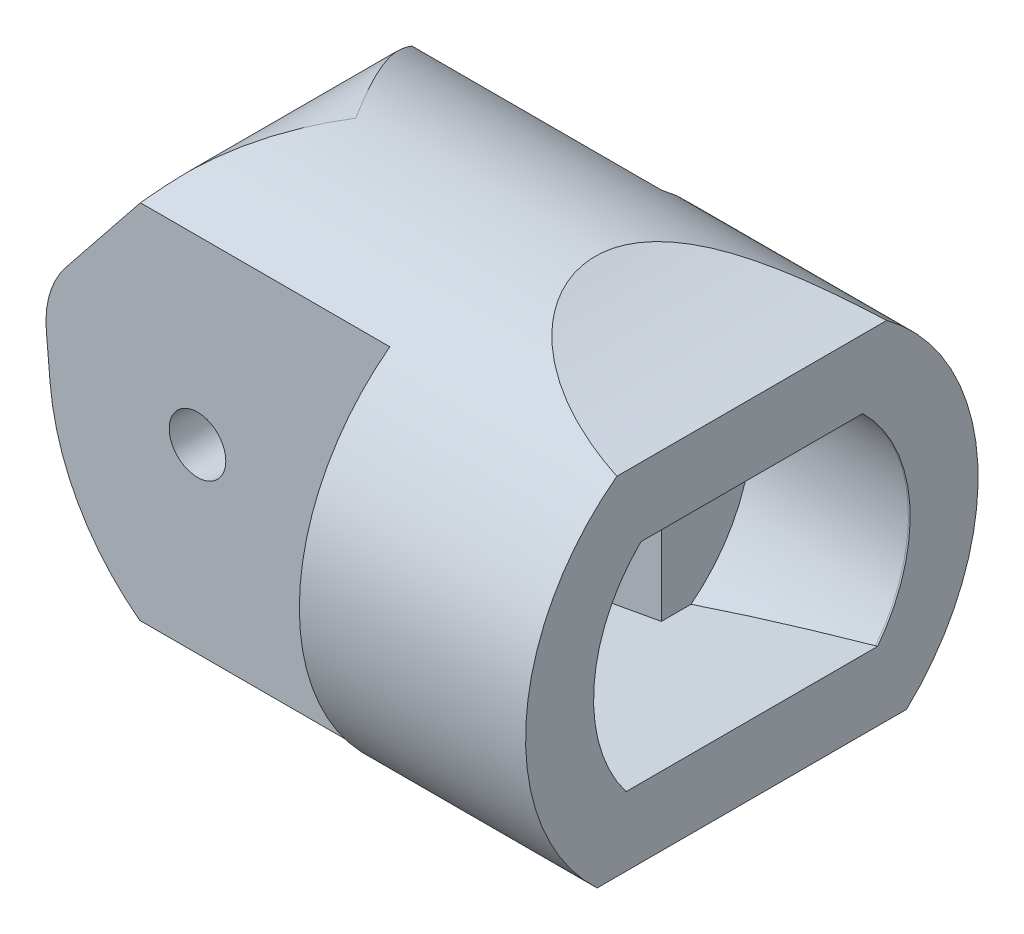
ISO-10303-21;
HEADER;
FILE_DESCRIPTION(('STEP AP214'),'2;1');
FILE_NAME('part.step','',(''),(''),'','','');
FILE_SCHEMA(('AUTOMOTIVE_DESIGN { 1 0 10303 214 1 1 1 1 }'));
ENDSEC;
DATA;
#1=APPLICATION_CONTEXT('core data for automotive mechanical design processes');
#2=APPLICATION_PROTOCOL_DEFINITION('international standard','automotive_design',2000,#1);
#3=PRODUCT_CONTEXT('',#1,'mechanical');
#4=PRODUCT('Part','Part','',(#3));
#5=PRODUCT_RELATED_PRODUCT_CATEGORY('part','',(#4));
#6=PRODUCT_DEFINITION_FORMATION('','',#4);
#7=PRODUCT_DEFINITION_CONTEXT('part definition',#1,'design');
#8=PRODUCT_DEFINITION('design','',#6,#7);
#9=PRODUCT_DEFINITION_SHAPE('','',#8);
#10=(LENGTH_UNIT() NAMED_UNIT(*) SI_UNIT(.MILLI.,.METRE.));
#11=(NAMED_UNIT(*) PLANE_ANGLE_UNIT() SI_UNIT($,.RADIAN.));
#12=(NAMED_UNIT(*) SI_UNIT($,.STERADIAN.) SOLID_ANGLE_UNIT());
#13=UNCERTAINTY_MEASURE_WITH_UNIT(LENGTH_MEASURE(1.E-05),#10,'distance_accuracy_value','');
#14=(GEOMETRIC_REPRESENTATION_CONTEXT(3) GLOBAL_UNCERTAINTY_ASSIGNED_CONTEXT((#13)) GLOBAL_UNIT_ASSIGNED_CONTEXT((#10,
#11,#12)) REPRESENTATION_CONTEXT('',''));
#15=CARTESIAN_POINT('',(0.,0.,0.));
#16=DIRECTION('',(0.,0.,1.));
#17=DIRECTION('',(1.,0.,0.));
#18=AXIS2_PLACEMENT_3D('',#15,#16,#17);
#19=CARTESIAN_POINT('',(-12.9467628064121,-1.13269497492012,0.));
#20=DIRECTION('',(-0.996194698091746,-0.087155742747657,0.));
#21=DIRECTION('',(0.087155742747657,-0.996194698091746,0.));
#22=AXIS2_PLACEMENT_3D('',#19,#20,#21);
#23=PLANE('',#22);
#24=DIRECTION('',(0.087155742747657,-0.996194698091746,0.));
#25=VECTOR('',#24,1.);
#26=CARTESIAN_POINT('',(-13.7271614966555,7.78730287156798,-3.));
#27=LINE('',#26,#25);
#28=CARTESIAN_POINT('',(-13.7271614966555,7.78730287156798,-3.));
#29=VERTEX_POINT('',#28);
#30=CARTESIAN_POINT('',(-13.5991876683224,6.32455532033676,-3.));
#31=VERTEX_POINT('',#30);
#32=EDGE_CURVE('E378',#29,#31,#27,.T.);
#33=ORIENTED_EDGE('',*,*,#32,.T.);
#34=CARTESIAN_POINT('',(-13.0458607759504,0.,0.));
#35=DIRECTION('',(-0.996194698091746,-0.087155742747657,0.));
#36=DIRECTION('',(0.087155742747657,-0.996194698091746,0.));
#37=AXIS2_PLACEMENT_3D('',#34,#35,#36);
#38=ELLIPSE('',#37,7.02673886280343,7.);
#39=CARTESIAN_POINT('',(-13.5991876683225,6.32455532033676,3.));
#40=VERTEX_POINT('',#39);
#41=EDGE_CURVE('E370',#31,#40,#38,.F.);
#42=ORIENTED_EDGE('',*,*,#41,.T.);
#43=DIRECTION('',(-0.087155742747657,0.996194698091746,0.));
#44=VECTOR('',#43,1.);
#45=CARTESIAN_POINT('',(-13.7271614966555,7.78730287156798,3.));
#46=LINE('',#45,#44);
#47=CARTESIAN_POINT('',(-13.7271614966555,7.78730287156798,3.));
#48=VERTEX_POINT('',#47);
#49=EDGE_CURVE('E384',#40,#48,#46,.T.);
#50=ORIENTED_EDGE('',*,*,#49,.T.);
#51=DIRECTION('',(0.,0.,-1.));
#52=VECTOR('',#51,1.);
#53=CARTESIAN_POINT('',(-13.7271614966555,7.78730287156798,-3.));
#54=LINE('',#53,#52);
#55=EDGE_CURVE('E386',#48,#29,#54,.T.);
#56=ORIENTED_EDGE('',*,*,#55,.T.);
#57=EDGE_LOOP('',(#33,#42,#50,#56));
#58=FACE_BOUND('',#57,.T.);
#59=ADVANCED_FACE('F34',(#58),#23,.T.);
#60=CARTESIAN_POINT('',(-18.5,0.,-10.));
#61=DIRECTION('',(0.,0.,1.));
#62=DIRECTION('',(1.,0.,0.));
#63=AXIS2_PLACEMENT_3D('',#60,#61,#62);
#64=CYLINDRICAL_SURFACE('',#63,1.25);
#65=CARTESIAN_POINT('',(-18.5,0.,-3.));
#66=DIRECTION('',(0.,0.,-1.));
#67=DIRECTION('',(0.,1.,0.));
#68=AXIS2_PLACEMENT_3D('',#65,#66,#67);
#69=CIRCLE('',#68,1.25);
#70=CARTESIAN_POINT('',(-18.5,1.25,-3.));
#71=VERTEX_POINT('',#70);
#72=EDGE_CURVE('E412',#71,#71,#69,.F.);
#73=ORIENTED_EDGE('',*,*,#72,.T.);
#74=EDGE_LOOP('',(#73));
#75=FACE_BOUND('',#74,.T.);
#76=CARTESIAN_POINT('',(-18.5,0.,-6.));
#77=DIRECTION('',(0.,0.,1.));
#78=DIRECTION('',(1.,0.,0.));
#79=AXIS2_PLACEMENT_3D('',#76,#77,#78);
#80=CIRCLE('',#79,1.25);
#81=CARTESIAN_POINT('',(-17.25,0.,-6.));
#82=VERTEX_POINT('',#81);
#83=EDGE_CURVE('E461',#82,#82,#80,.T.);
#84=ORIENTED_EDGE('',*,*,#83,.F.);
#85=EDGE_LOOP('',(#84));
#86=FACE_BOUND('',#85,.T.);
#87=ADVANCED_FACE('F529',(#75,#86),#64,.F.);
#88=CARTESIAN_POINT('',(-25.1817611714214,1.0294173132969,-10.));
#89=DIRECTION('',(-0.996194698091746,-0.0871557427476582,0.));
#90=DIRECTION('',(0.0871557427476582,-0.996194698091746,0.));
#91=AXIS2_PLACEMENT_3D('',#88,#89,#90);
#92=PLANE('',#91);
#93=DIRECTION('',(0.087155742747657,-0.996194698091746,0.));
#94=VECTOR('',#93,1.);
#95=CARTESIAN_POINT('',(-25.6814978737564,6.74143395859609,-3.));
#96=LINE('',#95,#94);
#97=CARTESIAN_POINT('',(-25.1817611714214,1.02941731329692,-3.));
#98=VERTEX_POINT('',#97);
#99=CARTESIAN_POINT('',(-25.0154474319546,-0.87155742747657,-3.));
#100=VERTEX_POINT('',#99);
#101=EDGE_CURVE('E377',#98,#100,#96,.T.);
#102=ORIENTED_EDGE('',*,*,#101,.F.);
#103=DIRECTION('',(0.,0.,1.));
#104=VECTOR('',#103,1.);
#105=CARTESIAN_POINT('',(-25.1817611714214,1.0294173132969,-10.));
#106=LINE('',#105,#104);
#107=CARTESIAN_POINT('',(-25.1817611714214,1.0294173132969,-6.));
#108=VERTEX_POINT('',#107);
#109=EDGE_CURVE('E430',#108,#98,#106,.T.);
#110=ORIENTED_EDGE('',*,*,#109,.F.);
#111=DIRECTION('',(0.0871557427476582,-0.996194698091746,0.));
#112=VECTOR('',#111,1.);
#113=CARTESIAN_POINT('',(-24.2303575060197,-9.84517634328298,-6.));
#114=LINE('',#113,#112);
#115=CARTESIAN_POINT('',(-25.0154474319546,-0.871557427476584,-6.));
#116=VERTEX_POINT('',#115);
#117=EDGE_CURVE('E496',#108,#116,#114,.T.);
#118=ORIENTED_EDGE('',*,*,#117,.T.);
#119=DIRECTION('',(0.,0.,1.));
#120=VECTOR('',#119,1.);
#121=CARTESIAN_POINT('',(-25.0154474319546,-0.871557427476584,-10.));
#122=LINE('',#121,#120);
#123=EDGE_CURVE('E425',#116,#100,#122,.T.);
#124=ORIENTED_EDGE('',*,*,#123,.T.);
#125=EDGE_LOOP('',(#102,#110,#118,#124));
#126=FACE_BOUND('',#125,.T.);
#127=ADVANCED_FACE('F557',(#126),#92,.T.);
#128=CARTESIAN_POINT('',(-21.1969823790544,1.37804028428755,-10.));
#129=DIRECTION('',(0.,0.,1.));
#130=DIRECTION('',(1.,0.,0.));
#131=AXIS2_PLACEMENT_3D('',#128,#129,#130);
#132=CYLINDRICAL_SURFACE('',#131,4.);
#133=CARTESIAN_POINT('',(-21.1969823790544,1.37804028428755,-3.));
#134=DIRECTION('',(0.,0.,-1.));
#135=DIRECTION('',(0.,1.,0.));
#136=AXIS2_PLACEMENT_3D('',#133,#134,#135);
#137=CIRCLE('',#136,4.);
#138=CARTESIAN_POINT('',(-24.3210892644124,3.87603071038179,-3.));
#139=VERTEX_POINT('',#138);
#140=EDGE_CURVE('E408',#139,#98,#137,.F.);
#141=ORIENTED_EDGE('',*,*,#140,.F.);
#142=DIRECTION('',(0.,0.,1.));
#143=VECTOR('',#142,1.);
#144=CARTESIAN_POINT('',(-24.3210892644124,3.87603071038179,-10.));
#145=LINE('',#144,#143);
#146=CARTESIAN_POINT('',(-24.3210892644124,3.87603071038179,-6.));
#147=VERTEX_POINT('',#146);
#148=EDGE_CURVE('E434',#147,#139,#145,.T.);
#149=ORIENTED_EDGE('',*,*,#148,.F.);
#150=CARTESIAN_POINT('',(-21.1969823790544,1.37804028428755,-6.));
#151=DIRECTION('',(0.,0.,1.));
#152=DIRECTION('',(1.,0.,0.));
#153=AXIS2_PLACEMENT_3D('',#150,#151,#152);
#154=CIRCLE('',#153,4.);
#155=EDGE_CURVE('E494',#147,#108,#154,.T.);
#156=ORIENTED_EDGE('',*,*,#155,.T.);
#157=ORIENTED_EDGE('',*,*,#109,.T.);
#158=EDGE_LOOP('',(#141,#149,#156,#157));
#159=FACE_BOUND('',#158,.T.);
#160=ADVANCED_FACE('F547',(#159),#132,.T.);
#161=CARTESIAN_POINT('',(-26.,0.,0.));
#162=DIRECTION('',(1.,0.,0.));
#163=DIRECTION('',(0.,0.,-1.));
#164=AXIS2_PLACEMENT_3D('',#161,#162,#163);
#165=CYLINDRICAL_SURFACE('',#164,10.);
#166=CARTESIAN_POINT('',(0.,8.02614477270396,-5.96498114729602));
#167=CARTESIAN_POINT('',(-0.217560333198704,8.06069658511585,-5.91845157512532));
#168=CARTESIAN_POINT('',(-0.434159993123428,8.09713199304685,-5.86861751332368));
#169=CARTESIAN_POINT('',(-0.865594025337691,8.17394539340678,-5.76117361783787));
#170=CARTESIAN_POINT('',(-1.08041877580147,8.2143376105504,-5.70353542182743));
#171=CARTESIAN_POINT('',(-1.50710797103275,8.29903883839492,-5.57956691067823));
#172=CARTESIAN_POINT('',(-1.71896807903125,8.34335300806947,-5.51322508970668));
#173=CARTESIAN_POINT('',(-2.14193046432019,8.43647333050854,-5.36967113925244));
#174=CARTESIAN_POINT('',(-2.35296667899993,8.48533988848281,-5.29230241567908));
#175=CARTESIAN_POINT('',(-2.76945206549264,8.58660271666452,-5.12637196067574));
#176=CARTESIAN_POINT('',(-2.97490749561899,8.6389947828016,-5.03782345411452));
#177=CARTESIAN_POINT('',(-3.37895655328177,8.74681308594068,-4.84821138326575));
#178=CARTESIAN_POINT('',(-3.57755617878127,8.80223655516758,-4.74715913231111));
#179=CARTESIAN_POINT('',(-3.92499850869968,8.90333522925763,-4.5540993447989));
#180=CARTESIAN_POINT('',(-4.07543879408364,8.94857613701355,-4.46474052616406));
#181=CARTESIAN_POINT('',(-4.37014405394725,9.03995713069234,-4.27669361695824));
#182=CARTESIAN_POINT('',(-4.51440841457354,9.08609730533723,-4.17800460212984));
#183=CARTESIAN_POINT('',(-4.79503116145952,9.17842381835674,-3.97106088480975));
#184=CARTESIAN_POINT('',(-4.93141705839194,9.22460934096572,-3.86284327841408));
#185=CARTESIAN_POINT('',(-5.19547112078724,9.31635717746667,-3.63599400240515));
#186=CARTESIAN_POINT('',(-5.32314099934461,9.36191961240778,-3.51736438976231));
#187=CARTESIAN_POINT('',(-5.54732523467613,9.44379136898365,-3.29040614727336));
#188=CARTESIAN_POINT('',(-5.64544544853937,9.48035649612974,-3.18375700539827));
#189=CARTESIAN_POINT('',(-5.8335343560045,9.55167154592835,-2.96294199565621));
#190=CARTESIAN_POINT('',(-5.92350510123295,9.58642192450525,-2.84877803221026));
#191=CARTESIAN_POINT('',(-6.09415371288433,9.65334626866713,-2.61302751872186));
#192=CARTESIAN_POINT('',(-6.17483467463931,9.68552109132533,-2.49144346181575));
#193=CARTESIAN_POINT('',(-6.32571751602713,9.74648310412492,-2.24112592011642));
#194=CARTESIAN_POINT('',(-6.39592170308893,9.77527103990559,-2.11239401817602));
#195=CARTESIAN_POINT('',(-6.51223016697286,9.82347974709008,-1.87378681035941));
#196=CARTESIAN_POINT('',(-6.56037223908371,9.84363696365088,-1.76505123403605));
#197=CARTESIAN_POINT('',(-6.64838958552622,9.88075747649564,-1.54376486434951));
#198=CARTESIAN_POINT('',(-6.6882666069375,9.89772144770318,-1.43121488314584));
#199=CARTESIAN_POINT('',(-6.75916561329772,9.92805127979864,-1.20293313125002));
#200=CARTESIAN_POINT('',(-6.79019152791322,9.94141873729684,-1.08720279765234));
#201=CARTESIAN_POINT('',(-6.84292017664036,9.96422509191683,-0.853246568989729));
#202=CARTESIAN_POINT('',(-6.86462277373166,9.97366393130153,-0.735020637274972));
#203=CARTESIAN_POINT('',(-6.89840417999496,9.98838747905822,-0.496443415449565));
#204=CARTESIAN_POINT('',(-6.91044317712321,9.99365500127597,-0.37608539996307));
#205=CARTESIAN_POINT('',(-6.92453306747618,9.99982210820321,-0.134671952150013));
#206=CARTESIAN_POINT('',(-6.92658394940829,10.0007216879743,-0.0136165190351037));
#207=CARTESIAN_POINT('',(-6.92066050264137,9.99812714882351,0.228197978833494));
#208=CARTESIAN_POINT('',(-6.91268633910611,9.99463310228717,0.348957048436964));
#209=CARTESIAN_POINT('',(-6.88685678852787,9.98335106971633,0.589205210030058));
#210=CARTESIAN_POINT('',(-6.869001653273,9.97556319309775,0.708694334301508));
#211=CARTESIAN_POINT('',(-6.82513706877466,9.95652394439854,0.938107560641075));
#212=CARTESIAN_POINT('',(-6.799705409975,9.94551877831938,1.04816354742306));
#213=CARTESIAN_POINT('',(-6.74079048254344,9.92017594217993,1.26574510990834));
#214=CARTESIAN_POINT('',(-6.7073041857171,9.90583701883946,1.37326971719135));
#215=CARTESIAN_POINT('',(-6.63273756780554,9.87414156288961,1.58518381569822));
#216=CARTESIAN_POINT('',(-6.59165743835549,9.85678510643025,1.68957338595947));
#217=CARTESIAN_POINT('',(-6.50240534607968,9.81940194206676,1.89479032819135));
#218=CARTESIAN_POINT('',(-6.45423190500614,9.79937467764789,1.99561695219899));
#219=CARTESIAN_POINT('',(-6.33305385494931,9.74949606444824,2.22847315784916));
#220=CARTESIAN_POINT('',(-6.25730481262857,9.71868090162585,2.35887495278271));
#221=CARTESIAN_POINT('',(-6.09510739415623,9.65374041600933,2.61196927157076));
#222=CARTESIAN_POINT('',(-6.00865590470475,9.61961413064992,2.73465953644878));
#223=CARTESIAN_POINT('',(-5.82628573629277,9.54890279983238,2.97217484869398));
#224=CARTESIAN_POINT('',(-5.7303593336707,9.51231575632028,3.086993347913));
#225=CARTESIAN_POINT('',(-5.53028228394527,9.43749831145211,3.30867290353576));
#226=CARTESIAN_POINT('',(-5.42612902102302,9.3992673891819,3.41553140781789));
#227=CARTESIAN_POINT('',(-5.16303049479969,9.30475346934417,3.66698113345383));
#228=CARTESIAN_POINT('',(-5.00022667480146,9.24796534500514,3.80735609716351));
#229=CARTESIAN_POINT('',(-4.66258416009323,9.13420847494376,4.0727254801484));
#230=CARTESIAN_POINT('',(-4.48773967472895,9.07723965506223,4.19771241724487));
#231=CARTESIAN_POINT('',(-4.12754014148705,8.96422316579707,4.43395136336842));
#232=CARTESIAN_POINT('',(-3.94214021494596,8.90818097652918,4.5451371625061));
#233=CARTESIAN_POINT('',(-3.56344782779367,8.79828854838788,4.75437556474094));
#234=CARTESIAN_POINT('',(-3.37015392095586,8.74443871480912,4.85242574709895));
#235=CARTESIAN_POINT('',(-3.00575653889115,8.64724885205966,5.02327394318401));
#236=CARTESIAN_POINT('',(-2.83550058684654,8.60351726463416,5.09767190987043));
#237=CARTESIAN_POINT('',(-2.49111030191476,8.51846238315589,5.23856594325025));
#238=CARTESIAN_POINT('',(-2.31697485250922,8.4771397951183,5.3050596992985));
#239=CARTESIAN_POINT('',(-1.96545557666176,8.39709126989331,5.43087649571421));
#240=CARTESIAN_POINT('',(-1.78807016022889,8.35836664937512,5.49019591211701));
#241=CARTESIAN_POINT('',(-1.43354163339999,8.2842362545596,5.60141217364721));
#242=CARTESIAN_POINT('',(-1.25643978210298,8.24878739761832,5.65341231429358));
#243=CARTESIAN_POINT('',(-0.900262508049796,8.18058065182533,5.75166837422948));
#244=CARTESIAN_POINT('',(-0.721188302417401,8.14782119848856,5.79792764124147));
#245=CARTESIAN_POINT('',(-0.361632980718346,8.08499302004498,5.88521161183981));
#246=CARTESIAN_POINT('',(-0.181154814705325,8.05491976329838,5.92624518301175));
#247=CARTESIAN_POINT('',(0.,8.02614477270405,5.96498114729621));
#248=B_SPLINE_CURVE_WITH_KNOTS('',3,(#166,#167,#168,#169,#170,#171,#172,#173,#174,#175,#176,
#177,#178,#179,#180,#181,#182,#183,#184,#185,#186,#187,#188,#189,#190,#191,#192,#193,#194,#195,
#196,#197,#198,#199,#200,#201,#202,#203,#204,#205,#206,#207,#208,#209,#210,#211,#212,#213,#214,
#215,#216,#217,#218,#219,#220,#221,#222,#223,#224,#225,#226,#227,#228,#229,#230,#231,#232,#233,
#234,#235,#236,#237,#238,#239,#240,#241,#242,#243,#244,#245,#246,#247),.UNSPECIFIED.,.F.,.F.,(4,
2,2,2,2,2,2,2,2,2,2,2,2,2,2,2,2,2,2,2,2,2,2,2,2,2,2,2,2,2,2,2,2,2,2,2,2,2,2,2,4),(0.,
0.675473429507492,1.35347112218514,2.03237430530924,2.72211298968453,3.41104327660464,
4.09935471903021,4.64124620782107,5.18319143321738,5.72311293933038,6.26292801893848,
6.71093393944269,7.15882675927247,7.60656990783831,8.05421429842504,8.41569730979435,
8.77710383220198,9.13834964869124,9.49960077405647,9.8623326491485,10.2250649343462,
10.5877912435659,10.9505083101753,11.2906114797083,11.6308427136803,11.9710653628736,
12.3113590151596,12.77244141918,13.2336582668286,13.695254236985,14.1569975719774,
14.8229763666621,15.4892777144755,16.1586612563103,16.8281679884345,17.400573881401,
17.9731466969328,18.5460075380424,19.1097316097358,19.6731253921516,20.2355500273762),.UNSPECIFIED.);
#249=CARTESIAN_POINT('',(0.,8.02614477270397,-5.96498114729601));
#250=VERTEX_POINT('',#249);
#251=CARTESIAN_POINT('',(0.,8.02614477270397,5.96498114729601));
#252=VERTEX_POINT('',#251);
#253=EDGE_CURVE('E418',#250,#252,#248,.T.);
#254=ORIENTED_EDGE('',*,*,#253,.F.);
#255=CARTESIAN_POINT('',(0.,0.,0.));
#256=DIRECTION('',(1.,0.,0.));
#257=DIRECTION('',(0.,0.,-1.));
#258=AXIS2_PLACEMENT_3D('',#255,#256,#257);
#259=CIRCLE('',#258,10.);
#260=CARTESIAN_POINT('',(0.,-7.2968195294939,-6.83786697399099));
#261=VERTEX_POINT('',#260);
#262=EDGE_CURVE('E481',#261,#250,#259,.T.);
#263=ORIENTED_EDGE('',*,*,#262,.F.);
#264=CARTESIAN_POINT('',(40.3837969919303,0.,0.));
#265=DIRECTION('',(-0.177807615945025,0.984065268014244,0.));
#266=DIRECTION('',(0.984065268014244,0.177807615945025,0.));
#267=AXIS2_PLACEMENT_3D('',#264,#265,#266);
#268=ELLIPSE('',#267,56.2405606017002,10.);
#269=CARTESIAN_POINT('',(0.,-7.2968195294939,6.83786697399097));
#270=VERTEX_POINT('',#269);
#271=EDGE_CURVE('E415',#270,#261,#268,.F.);
#272=ORIENTED_EDGE('',*,*,#271,.F.);
#273=EDGE_CURVE('E483',#252,#270,#259,.T.);
#274=ORIENTED_EDGE('',*,*,#273,.F.);
#275=EDGE_LOOP('',(#254,#263,#272,#274));
#276=FACE_BOUND('',#275,.T.);
#277=CARTESIAN_POINT('',(-20.6254375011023,8.49799042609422,-5.27106808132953));
#278=CARTESIAN_POINT('',(-20.5671299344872,8.57090207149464,-5.15351552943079));
#279=CARTESIAN_POINT('',(-20.5069495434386,8.64094458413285,-5.03515302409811));
#280=CARTESIAN_POINT('',(-20.383270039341,8.775387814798,-4.79700674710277));
#281=CARTESIAN_POINT('',(-20.3197716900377,8.83978982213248,-4.67722330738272));
#282=CARTESIAN_POINT('',(-20.125051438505,9.02458249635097,-4.31624190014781));
#283=CARTESIAN_POINT('',(-19.9894649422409,9.13673112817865,-4.0731349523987));
#284=CARTESIAN_POINT('',(-19.7099064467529,9.33944937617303,-3.58393723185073));
#285=CARTESIAN_POINT('',(-19.5659598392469,9.4300804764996,-3.33785712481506));
#286=CARTESIAN_POINT('',(-19.2715161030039,9.59090208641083,-2.84293751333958));
#287=CARTESIAN_POINT('',(-19.1210178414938,9.66108904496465,-2.59409753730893));
#288=CARTESIAN_POINT('',(-18.7326227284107,9.81419386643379,-1.95922729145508));
#289=CARTESIAN_POINT('',(-18.4915045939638,9.88344555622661,-1.57183121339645));
#290=CARTESIAN_POINT('',(-18.004219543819,9.97599229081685,-0.795177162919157));
#291=CARTESIAN_POINT('',(-17.7580573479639,9.99932847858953,-0.405921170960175));
#292=CARTESIAN_POINT('',(-17.5084575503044,9.99999523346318,-0.0112686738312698));
#293=CARTESIAN_POINT('',(-17.5048940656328,9.99999999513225,-0.00563430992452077));
#294=CARTESIAN_POINT('',(-17.5013306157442,10.,0.));
#295=B_SPLINE_CURVE_WITH_KNOTS('',3,(#277,#278,#279,#280,#281,#282,#283,#284,#285,#286,#287,
#288,#289,#290,#291,#292,#293,#294),.UNSPECIFIED.,.F.,.F.,(4,2,2,2,2,2,2,2,4),(0.,
0.450248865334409,0.900394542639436,1.79962462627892,2.69625346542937,3.59303795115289,
4.97514175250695,6.35600654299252,6.37600654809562),.UNSPECIFIED.);
#296=CARTESIAN_POINT('',(-20.6254375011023,8.49799042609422,-5.27106808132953));
#297=VERTEX_POINT('',#296);
#298=CARTESIAN_POINT('',(-17.5013306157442,10.,0.));
#299=VERTEX_POINT('',#298);
#300=EDGE_CURVE('E500',#297,#299,#295,.T.);
#301=ORIENTED_EDGE('',*,*,#300,.T.);
#302=CARTESIAN_POINT('',(-20.6254375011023,8.49799042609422,5.27106808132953));
#303=CARTESIAN_POINT('',(-20.5671299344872,8.57090207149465,5.15351552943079));
#304=CARTESIAN_POINT('',(-20.5069495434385,8.64094458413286,5.03515302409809));
#305=CARTESIAN_POINT('',(-20.383270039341,8.77538781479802,4.79700674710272));
#306=CARTESIAN_POINT('',(-20.3197716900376,8.83978982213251,4.67722330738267));
#307=CARTESIAN_POINT('',(-20.125051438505,9.02458249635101,4.31624190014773));
#308=CARTESIAN_POINT('',(-19.9894649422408,9.1367311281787,4.07313495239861));
#309=CARTESIAN_POINT('',(-19.7099064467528,9.33944937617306,3.58393723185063));
#310=CARTESIAN_POINT('',(-19.5659598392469,9.43008047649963,3.33785712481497));
#311=CARTESIAN_POINT('',(-19.2715161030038,9.59090208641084,2.84293751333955));
#312=CARTESIAN_POINT('',(-19.1210178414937,9.66108904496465,2.59409753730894));
#313=CARTESIAN_POINT('',(-18.7326227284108,9.81419386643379,1.95922729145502));
#314=CARTESIAN_POINT('',(-18.4915045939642,9.88344555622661,1.57183121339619));
#315=CARTESIAN_POINT('',(-18.0042195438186,9.97599229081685,0.795177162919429));
#316=CARTESIAN_POINT('',(-17.7580573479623,9.99932847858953,0.405921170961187));
#317=CARTESIAN_POINT('',(-17.5084575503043,9.99999523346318,0.0112686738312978));
#318=CARTESIAN_POINT('',(-17.5048940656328,9.99999999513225,0.00563430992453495));
#319=CARTESIAN_POINT('',(-17.5013306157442,10.,0.));
#320=B_SPLINE_CURVE_WITH_KNOTS('',3,(#302,#303,#304,#305,#306,#307,#308,#309,#310,#311,#312,
#313,#314,#315,#316,#317,#318,#319),.UNSPECIFIED.,.F.,.F.,(4,2,2,2,2,2,2,2,4),(0.,
0.450248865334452,0.900394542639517,1.79962462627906,2.69625346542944,3.59303795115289,
4.97514175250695,6.35600654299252,6.37600654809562),.UNSPECIFIED.);
#321=CARTESIAN_POINT('',(-20.6254375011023,8.49799042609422,5.27106808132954));
#322=VERTEX_POINT('',#321);
#323=EDGE_CURVE('E507',#299,#322,#320,.F.);
#324=ORIENTED_EDGE('',*,*,#323,.T.);
#325=CARTESIAN_POINT('',(-27.4203070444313,0.,0.));
#326=DIRECTION('',(-0.781026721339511,0.624497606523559,0.));
#327=DIRECTION('',(0.624497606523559,0.781026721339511,0.));
#328=AXIS2_PLACEMENT_3D('',#325,#326,#327);
#329=ELLIPSE('',#328,12.8036592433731,10.);
#330=CARTESIAN_POINT('',(-21.0236234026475,8.,6.));
#331=VERTEX_POINT('',#330);
#332=EDGE_CURVE('E443',#322,#331,#329,.F.);
#333=ORIENTED_EDGE('',*,*,#332,.T.);
#334=DIRECTION('',(1.,0.,0.));
#335=VECTOR('',#334,1.);
#336=CARTESIAN_POINT('',(-26.,8.,6.));
#337=LINE('',#336,#335);
#338=CARTESIAN_POINT('',(-10.,8.,6.));
#339=VERTEX_POINT('',#338);
#340=EDGE_CURVE('E476',#331,#339,#337,.T.);
#341=ORIENTED_EDGE('',*,*,#340,.T.);
#342=CARTESIAN_POINT('',(-9.99999999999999,0.,0.));
#343=DIRECTION('',(1.,0.,0.));
#344=DIRECTION('',(0.,0.,-1.));
#345=AXIS2_PLACEMENT_3D('',#342,#343,#344);
#346=CIRCLE('',#345,10.);
#347=CARTESIAN_POINT('',(-10.,-8.,6.));
#348=VERTEX_POINT('',#347);
#349=EDGE_CURVE('E484',#348,#339,#346,.F.);
#350=ORIENTED_EDGE('',*,*,#349,.F.);
#351=DIRECTION('',(1.,0.,0.));
#352=VECTOR('',#351,1.);
#353=CARTESIAN_POINT('',(-26.,-8.,6.));
#354=LINE('',#353,#352);
#355=CARTESIAN_POINT('',(-21.0535004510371,-8.,6.));
#356=VERTEX_POINT('',#355);
#357=EDGE_CURVE('E478',#348,#356,#354,.F.);
#358=ORIENTED_EDGE('',*,*,#357,.T.);
#359=CARTESIAN_POINT('',(-15.0535004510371,0.,0.));
#360=DIRECTION('',(0.707106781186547,0.,0.707106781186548));
#361=DIRECTION('',(0.707106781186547,0.,-0.707106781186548));
#362=AXIS2_PLACEMENT_3D('',#359,#360,#361);
#363=ELLIPSE('',#362,14.142135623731,10.);
#364=CARTESIAN_POINT('',(-15.0535004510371,-10.,0.));
#365=VERTEX_POINT('',#364);
#366=EDGE_CURVE('E455',#356,#365,#363,.T.);
#367=ORIENTED_EDGE('',*,*,#366,.T.);
#368=CARTESIAN_POINT('',(-15.0535004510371,0.,0.));
#369=DIRECTION('',(0.707106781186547,0.,-0.707106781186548));
#370=DIRECTION('',(0.707106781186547,0.,0.707106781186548));
#371=AXIS2_PLACEMENT_3D('',#368,#369,#370);
#372=ELLIPSE('',#371,14.142135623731,10.);
#373=CARTESIAN_POINT('',(-21.0535004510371,-7.99999999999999,-6.));
#374=VERTEX_POINT('',#373);
#375=EDGE_CURVE('E452',#365,#374,#372,.T.);
#376=ORIENTED_EDGE('',*,*,#375,.T.);
#377=DIRECTION('',(1.,0.,0.));
#378=VECTOR('',#377,1.);
#379=CARTESIAN_POINT('',(-26.,-8.,-6.));
#380=LINE('',#379,#378);
#381=CARTESIAN_POINT('',(-9.99999999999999,-8.,-6.));
#382=VERTEX_POINT('',#381);
#383=EDGE_CURVE('E470',#382,#374,#380,.F.);
#384=ORIENTED_EDGE('',*,*,#383,.F.);
#385=CARTESIAN_POINT('',(-9.99999999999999,0.,0.));
#386=DIRECTION('',(-1.,0.,0.));
#387=DIRECTION('',(0.,0.,1.));
#388=AXIS2_PLACEMENT_3D('',#385,#386,#387);
#389=CIRCLE('',#388,10.);
#390=CARTESIAN_POINT('',(-9.99999999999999,8.,-6.));
#391=VERTEX_POINT('',#390);
#392=EDGE_CURVE('E487',#382,#391,#389,.F.);
#393=ORIENTED_EDGE('',*,*,#392,.T.);
#394=DIRECTION('',(1.,0.,0.));
#395=VECTOR('',#394,1.);
#396=CARTESIAN_POINT('',(-26.,8.,-6.));
#397=LINE('',#396,#395);
#398=CARTESIAN_POINT('',(-21.0236234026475,8.,-6.));
#399=VERTEX_POINT('',#398);
#400=EDGE_CURVE('E468',#399,#391,#397,.T.);
#401=ORIENTED_EDGE('',*,*,#400,.F.);
#402=EDGE_CURVE('E428',#399,#297,#329,.F.);
#403=ORIENTED_EDGE('',*,*,#402,.T.);
#404=EDGE_LOOP('',(#301,#324,#333,#341,#350,#358,#367,#376,#384,#393,#401,#403));
#405=FACE_BOUND('',#404,.T.);
#406=ADVANCED_FACE('F36',(#276,#405),#165,.T.);
#407=CARTESIAN_POINT('',(-26.,-10.,6.));
#408=DIRECTION('',(0.,0.,1.));
#409=DIRECTION('',(1.,0.,0.));
#410=AXIS2_PLACEMENT_3D('',#407,#408,#409);
#411=PLANE('',#410);
#412=CARTESIAN_POINT('',(-18.5,0.,6.));
#413=DIRECTION('',(0.,0.,1.));
#414=DIRECTION('',(1.,0.,0.));
#415=AXIS2_PLACEMENT_3D('',#412,#413,#414);
#416=CIRCLE('',#415,1.25);
#417=CARTESIAN_POINT('',(-17.25,0.,6.));
#418=VERTEX_POINT('',#417);
#419=EDGE_CURVE('E462',#418,#418,#416,.T.);
#420=ORIENTED_EDGE('',*,*,#419,.F.);
#421=EDGE_LOOP('',(#420));
#422=FACE_BOUND('',#421,.T.);
#423=DIRECTION('',(0.0871557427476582,-0.996194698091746,0.));
#424=VECTOR('',#423,1.);
#425=CARTESIAN_POINT('',(-24.2303575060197,-9.84517634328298,6.));
#426=LINE('',#425,#424);
#427=CARTESIAN_POINT('',(-25.1817611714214,1.0294173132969,6.));
#428=VERTEX_POINT('',#427);
#429=CARTESIAN_POINT('',(-25.0154474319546,-0.871557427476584,6.));
#430=VERTEX_POINT('',#429);
#431=EDGE_CURVE('E449',#428,#430,#426,.T.);
#432=ORIENTED_EDGE('',*,*,#431,.T.);
#433=CARTESIAN_POINT('',(-15.0535004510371,0.,6.));
#434=DIRECTION('',(0.,0.,1.));
#435=DIRECTION('',(1.,0.,0.));
#436=AXIS2_PLACEMENT_3D('',#433,#434,#435);
#437=CIRCLE('',#436,10.);
#438=EDGE_CURVE('E458',#430,#356,#437,.T.);
#439=ORIENTED_EDGE('',*,*,#438,.T.);
#440=ORIENTED_EDGE('',*,*,#357,.F.);
#441=DIRECTION('',(0.,1.,0.));
#442=VECTOR('',#441,1.);
#443=CARTESIAN_POINT('',(-9.99999999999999,-10.,6.));
#444=LINE('',#443,#442);
#445=EDGE_CURVE('E473',#348,#339,#444,.T.);
#446=ORIENTED_EDGE('',*,*,#445,.T.);
#447=ORIENTED_EDGE('',*,*,#340,.F.);
#448=DIRECTION('',(-0.624497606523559,-0.781026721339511,0.));
#449=VECTOR('',#448,1.);
#450=CARTESIAN_POINT('',(-31.7438843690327,-5.40727360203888,6.));
#451=LINE('',#450,#449);
#452=CARTESIAN_POINT('',(-24.3210892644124,3.87603071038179,6.));
#453=VERTEX_POINT('',#452);
#454=EDGE_CURVE('E442',#331,#453,#451,.T.);
#455=ORIENTED_EDGE('',*,*,#454,.T.);
#456=CARTESIAN_POINT('',(-21.1969823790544,1.37804028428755,6.));
#457=DIRECTION('',(0.,0.,1.));
#458=DIRECTION('',(1.,0.,0.));
#459=AXIS2_PLACEMENT_3D('',#456,#457,#458);
#460=CIRCLE('',#459,4.);
#461=EDGE_CURVE('E446',#453,#428,#460,.T.);
#462=ORIENTED_EDGE('',*,*,#461,.T.);
#463=EDGE_LOOP('',(#432,#439,#440,#446,#447,#455,#462));
#464=FACE_BOUND('',#463,.T.);
#465=ADVANCED_FACE('F537',(#422,#464),#411,.T.);
#466=CARTESIAN_POINT('',(-26.,-10.,-6.));
#467=DIRECTION('',(0.,0.,1.));
#468=DIRECTION('',(1.,0.,0.));
#469=AXIS2_PLACEMENT_3D('',#466,#467,#468);
#470=PLANE('',#469);
#471=ORIENTED_EDGE('',*,*,#83,.T.);
#472=EDGE_LOOP('',(#471));
#473=FACE_BOUND('',#472,.T.);
#474=CARTESIAN_POINT('',(-15.0535004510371,0.,-6.));
#475=DIRECTION('',(0.,0.,1.));
#476=DIRECTION('',(1.,0.,0.));
#477=AXIS2_PLACEMENT_3D('',#474,#475,#476);
#478=CIRCLE('',#477,10.);
#479=EDGE_CURVE('E498',#116,#374,#478,.T.);
#480=ORIENTED_EDGE('',*,*,#479,.F.);
#481=ORIENTED_EDGE('',*,*,#117,.F.);
#482=ORIENTED_EDGE('',*,*,#155,.F.);
#483=DIRECTION('',(-0.624497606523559,-0.781026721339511,0.));
#484=VECTOR('',#483,1.);
#485=CARTESIAN_POINT('',(-31.7438843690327,-5.40727360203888,-6.));
#486=LINE('',#485,#484);
#487=EDGE_CURVE('E490',#399,#147,#486,.T.);
#488=ORIENTED_EDGE('',*,*,#487,.F.);
#489=ORIENTED_EDGE('',*,*,#400,.T.);
#490=DIRECTION('',(0.,1.,0.));
#491=VECTOR('',#490,1.);
#492=CARTESIAN_POINT('',(-9.99999999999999,-10.,-6.));
#493=LINE('',#492,#491);
#494=EDGE_CURVE('E465',#382,#391,#493,.T.);
#495=ORIENTED_EDGE('',*,*,#494,.F.);
#496=ORIENTED_EDGE('',*,*,#383,.T.);
#497=EDGE_LOOP('',(#480,#481,#482,#488,#489,#495,#496));
#498=FACE_BOUND('',#497,.T.);
#499=ADVANCED_FACE('F534',(#473,#498),#470,.F.);
#500=CARTESIAN_POINT('',(-10.,-10.,10.));
#501=DIRECTION('',(1.,0.,0.));
#502=DIRECTION('',(0.,0.,-1.));
#503=AXIS2_PLACEMENT_3D('',#500,#501,#502);
#504=PLANE('',#503);
#505=ORIENTED_EDGE('',*,*,#445,.F.);
#506=ORIENTED_EDGE('',*,*,#349,.T.);
#507=EDGE_LOOP('',(#505,#506));
#508=FACE_BOUND('',#507,.T.);
#509=ADVANCED_FACE('F532',(#508),#504,.F.);
#510=CARTESIAN_POINT('',(-10.,-10.,-10.));
#511=DIRECTION('',(-1.,0.,0.));
#512=DIRECTION('',(0.,0.,1.));
#513=AXIS2_PLACEMENT_3D('',#510,#511,#512);
#514=PLANE('',#513);
#515=ORIENTED_EDGE('',*,*,#494,.T.);
#516=ORIENTED_EDGE('',*,*,#392,.F.);
#517=EDGE_LOOP('',(#515,#516));
#518=FACE_BOUND('',#517,.T.);
#519=ADVANCED_FACE('F527',(#518),#514,.T.);
#520=CARTESIAN_POINT('',(-18.5,0.,3.));
#521=DIRECTION('',(0.,0.,1.));
#522=DIRECTION('',(0.,-1.,0.));
#523=AXIS2_PLACEMENT_3D('',#520,#521,#522);
#524=CIRCLE('',#523,1.25);
#525=CARTESIAN_POINT('',(-18.5,-1.25,3.));
#526=VERTEX_POINT('',#525);
#527=EDGE_CURVE('E405',#526,#526,#524,.F.);
#528=ORIENTED_EDGE('',*,*,#527,.T.);
#529=EDGE_LOOP('',(#528));
#530=FACE_BOUND('',#529,.T.);
#531=ORIENTED_EDGE('',*,*,#419,.T.);
#532=EDGE_LOOP('',(#531));
#533=FACE_BOUND('',#532,.T.);
#534=ADVANCED_FACE('F522',(#530,#533),#64,.F.);
#535=DIRECTION('',(-0.087155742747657,0.996194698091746,0.));
#536=VECTOR('',#535,1.);
#537=CARTESIAN_POINT('',(-25.6814978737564,6.74143395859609,3.));
#538=LINE('',#537,#536);
#539=CARTESIAN_POINT('',(-25.0154474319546,-0.87155742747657,3.));
#540=VERTEX_POINT('',#539);
#541=CARTESIAN_POINT('',(-25.1817611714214,1.02941731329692,3.));
#542=VERTEX_POINT('',#541);
#543=EDGE_CURVE('E382',#540,#542,#538,.T.);
#544=ORIENTED_EDGE('',*,*,#543,.F.);
#545=EDGE_CURVE('E429',#540,#430,#122,.T.);
#546=ORIENTED_EDGE('',*,*,#545,.T.);
#547=ORIENTED_EDGE('',*,*,#431,.F.);
#548=EDGE_CURVE('E433',#542,#428,#106,.T.);
#549=ORIENTED_EDGE('',*,*,#548,.F.);
#550=EDGE_LOOP('',(#544,#546,#547,#549));
#551=FACE_BOUND('',#550,.T.);
#552=ADVANCED_FACE('F526',(#551),#92,.T.);
#553=CARTESIAN_POINT('',(-21.1969823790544,1.37804028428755,3.));
#554=DIRECTION('',(0.,0.,1.));
#555=DIRECTION('',(0.,-1.,0.));
#556=AXIS2_PLACEMENT_3D('',#553,#554,#555);
#557=CIRCLE('',#556,4.);
#558=CARTESIAN_POINT('',(-24.3210892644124,3.87603071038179,3.));
#559=VERTEX_POINT('',#558);
#560=EDGE_CURVE('E394',#542,#559,#557,.F.);
#561=ORIENTED_EDGE('',*,*,#560,.F.);
#562=ORIENTED_EDGE('',*,*,#548,.T.);
#563=ORIENTED_EDGE('',*,*,#461,.F.);
#564=EDGE_CURVE('E437',#559,#453,#145,.T.);
#565=ORIENTED_EDGE('',*,*,#564,.F.);
#566=EDGE_LOOP('',(#561,#562,#563,#565));
#567=FACE_BOUND('',#566,.T.);
#568=ADVANCED_FACE('F518',(#567),#132,.T.);
#569=CARTESIAN_POINT('',(-17.5013306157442,6.,-10.));
#570=DIRECTION('',(0.,0.,1.));
#571=DIRECTION('',(1.,0.,0.));
#572=AXIS2_PLACEMENT_3D('',#569,#570,#571);
#573=CYLINDRICAL_SURFACE('',#572,4.);
#574=DIRECTION('',(0.,0.,1.));
#575=VECTOR('',#574,1.);
#576=CARTESIAN_POINT('',(-20.6254375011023,8.49799042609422,-10.));
#577=LINE('',#576,#575);
#578=EDGE_CURVE('E424',#297,#322,#577,.T.);
#579=ORIENTED_EDGE('',*,*,#578,.T.);
#580=ORIENTED_EDGE('',*,*,#323,.F.);
#581=ORIENTED_EDGE('',*,*,#300,.F.);
#582=EDGE_LOOP('',(#579,#580,#581));
#583=FACE_BOUND('',#582,.T.);
#584=ADVANCED_FACE('F512',(#583),#573,.T.);
#585=CARTESIAN_POINT('',(-15.0535004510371,0.,-10.));
#586=DIRECTION('',(0.,0.,1.));
#587=DIRECTION('',(1.,0.,0.));
#588=AXIS2_PLACEMENT_3D('',#585,#586,#587);
#589=CYLINDRICAL_SURFACE('',#588,10.);
#590=CARTESIAN_POINT('',(-15.0535004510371,0.,-3.));
#591=DIRECTION('',(0.,0.,-1.));
#592=DIRECTION('',(0.,1.,0.));
#593=AXIS2_PLACEMENT_3D('',#590,#591,#592);
#594=CIRCLE('',#593,10.);
#595=CARTESIAN_POINT('',(-22.1885964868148,-7.0064544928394,-3.));
#596=VERTEX_POINT('',#595);
#597=EDGE_CURVE('E410',#100,#596,#594,.F.);
#598=ORIENTED_EDGE('',*,*,#597,.F.);
#599=ORIENTED_EDGE('',*,*,#123,.F.);
#600=ORIENTED_EDGE('',*,*,#479,.T.);
#601=ORIENTED_EDGE('',*,*,#375,.F.);
#602=ORIENTED_EDGE('',*,*,#366,.F.);
#603=ORIENTED_EDGE('',*,*,#438,.F.);
#604=ORIENTED_EDGE('',*,*,#545,.F.);
#605=CARTESIAN_POINT('',(-15.0535004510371,0.,3.));
#606=DIRECTION('',(0.,0.,1.));
#607=DIRECTION('',(0.,-1.,0.));
#608=AXIS2_PLACEMENT_3D('',#605,#606,#607);
#609=CIRCLE('',#608,10.);
#610=CARTESIAN_POINT('',(-22.1885964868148,-7.0064544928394,3.));
#611=VERTEX_POINT('',#610);
#612=EDGE_CURVE('E403',#611,#540,#609,.F.);
#613=ORIENTED_EDGE('',*,*,#612,.F.);
#614=DIRECTION('',(0.,0.,1.));
#615=VECTOR('',#614,1.);
#616=CARTESIAN_POINT('',(-22.1885964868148,-7.0064544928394,-10.));
#617=LINE('',#616,#615);
#618=EDGE_CURVE('E43',#596,#611,#617,.T.);
#619=ORIENTED_EDGE('',*,*,#618,.F.);
#620=EDGE_LOOP('',(#598,#599,#600,#601,#602,#603,#604,#613,#619));
#621=FACE_BOUND('',#620,.T.);
#622=ADVANCED_FACE('F517',(#621),#589,.T.);
#623=CARTESIAN_POINT('',(-24.3210892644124,3.87603071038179,-10.));
#624=DIRECTION('',(-0.781026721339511,0.624497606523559,0.));
#625=DIRECTION('',(-0.624497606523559,-0.781026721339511,0.));
#626=AXIS2_PLACEMENT_3D('',#623,#624,#625);
#627=PLANE('',#626);
#628=DIRECTION('',(-0.624497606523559,-0.781026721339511,0.));
#629=VECTOR('',#628,1.);
#630=CARTESIAN_POINT('',(-24.3210892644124,3.87603071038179,-3.));
#631=LINE('',#630,#629);
#632=CARTESIAN_POINT('',(-21.755298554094,7.08493188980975,-3.));
#633=VERTEX_POINT('',#632);
#634=EDGE_CURVE('E603',#633,#139,#631,.T.);
#635=ORIENTED_EDGE('',*,*,#634,.F.);
#636=DIRECTION('',(0.,0.,-1.));
#637=VECTOR('',#636,1.);
#638=CARTESIAN_POINT('',(-21.755298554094,7.08493188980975,-10.));
#639=LINE('',#638,#637);
#640=CARTESIAN_POINT('',(-21.755298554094,7.08493188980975,3.));
#641=VERTEX_POINT('',#640);
#642=EDGE_CURVE('E629',#641,#633,#639,.T.);
#643=ORIENTED_EDGE('',*,*,#642,.F.);
#644=DIRECTION('',(0.624497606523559,0.781026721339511,0.));
#645=VECTOR('',#644,1.);
#646=CARTESIAN_POINT('',(-24.3210892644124,3.87603071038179,3.));
#647=LINE('',#646,#645);
#648=EDGE_CURVE('E632',#559,#641,#647,.T.);
#649=ORIENTED_EDGE('',*,*,#648,.F.);
#650=ORIENTED_EDGE('',*,*,#564,.T.);
#651=ORIENTED_EDGE('',*,*,#454,.F.);
#652=ORIENTED_EDGE('',*,*,#332,.F.);
#653=ORIENTED_EDGE('',*,*,#578,.F.);
#654=ORIENTED_EDGE('',*,*,#402,.F.);
#655=ORIENTED_EDGE('',*,*,#487,.T.);
#656=ORIENTED_EDGE('',*,*,#148,.T.);
#657=EDGE_LOOP('',(#635,#643,#649,#650,#651,#652,#653,#654,#655,#656));
#658=FACE_BOUND('',#657,.T.);
#659=ADVANCED_FACE('F520',(#658),#627,.T.);
#660=CARTESIAN_POINT('',(15.,-4.58651735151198,-10.));
#661=DIRECTION('',(-0.177807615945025,0.984065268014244,0.));
#662=DIRECTION('',(-0.984065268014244,-0.177807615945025,0.));
#663=AXIS2_PLACEMENT_3D('',#660,#661,#662);
#664=PLANE('',#663);
#665=ORIENTED_EDGE('',*,*,#271,.T.);
#666=DIRECTION('',(0.,0.,1.));
#667=VECTOR('',#666,1.);
#668=CARTESIAN_POINT('',(0.,-7.2968195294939,-10.));
#669=LINE('',#668,#667);
#670=EDGE_CURVE('E294',#261,#270,#669,.T.);
#671=ORIENTED_EDGE('',*,*,#670,.T.);
#672=EDGE_LOOP('',(#665,#671));
#673=FACE_BOUND('',#672,.T.);
#674=ADVANCED_FACE('F284',(#673),#664,.F.);
#675=CARTESIAN_POINT('',(-6.92493619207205,10.,-10.));
#676=CARTESIAN_POINT('',(-1.61304901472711,7.67295328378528,-10.));
#677=CARTESIAN_POINT('',(8.92108037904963,7.41860952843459,-10.));
#678=CARTESIAN_POINT('',(21.7939957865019,6.69860520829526,-10.));
#679=CARTESIAN_POINT('',(15.,-4.58651735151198,-10.));
#680=B_SPLINE_CURVE_WITH_KNOTS('',3,(#675,#676,#677,#678,#679),.UNSPECIFIED.,.F.,.F.,(4,1,4),
(0.,0.499244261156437,1.),.UNSPECIFIED.);
#681=DIRECTION('',(0.,0.,1.));
#682=VECTOR('',#681,1.);
#683=SURFACE_OF_LINEAR_EXTRUSION('',#680,#682);
#684=ORIENTED_EDGE('',*,*,#253,.T.);
#685=DIRECTION('',(0.,0.,1.));
#686=VECTOR('',#685,1.);
#687=CARTESIAN_POINT('',(0.,8.02614477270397,0.0349170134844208));
#688=LINE('',#687,#686);
#689=EDGE_CURVE('E856',#252,#250,#688,.F.);
#690=ORIENTED_EDGE('',*,*,#689,.T.);
#691=EDGE_LOOP('',(#684,#690));
#692=FACE_BOUND('',#691,.T.);
#693=ADVANCED_FACE('F278',(#692),#683,.F.);
#694=CARTESIAN_POINT('',(-13.7271614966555,7.78730287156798,-3.));
#695=DIRECTION('',(0.,0.,-1.));
#696=DIRECTION('',(0.,1.,0.));
#697=AXIS2_PLACEMENT_3D('',#694,#695,#696);
#698=PLANE('',#697);
#699=ORIENTED_EDGE('',*,*,#597,.T.);
#700=DIRECTION('',(-0.996194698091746,-0.087155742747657,0.));
#701=VECTOR('',#700,1.);
#702=CARTESIAN_POINT('',(-12.5069810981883,-6.15942290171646,-3.));
#703=LINE('',#702,#701);
#704=CARTESIAN_POINT('',(-12.5069810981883,-6.15942290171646,-3.));
#705=VERTEX_POINT('',#704);
#706=EDGE_CURVE('E362',#705,#596,#703,.T.);
#707=ORIENTED_EDGE('',*,*,#706,.F.);
#708=DIRECTION('',(0.087155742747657,-0.996194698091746,0.));
#709=VECTOR('',#708,1.);
#710=CARTESIAN_POINT('',(-12.2760211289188,-8.7993074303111,-3.));
#711=LINE('',#710,#709);
#712=CARTESIAN_POINT('',(-12.4925338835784,-6.32455532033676,-3.));
#713=VERTEX_POINT('',#712);
#714=EDGE_CURVE('E357',#705,#713,#711,.T.);
#715=ORIENTED_EDGE('',*,*,#714,.T.);
#716=DIRECTION('',(1.,0.,0.));
#717=VECTOR('',#716,1.);
#718=CARTESIAN_POINT('',(-6.99999999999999,-6.32455532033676,-3.));
#719=LINE('',#718,#717);
#720=CARTESIAN_POINT('',(-11.4912319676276,-6.32455532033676,-3.));
#721=VERTEX_POINT('',#720);
#722=EDGE_CURVE('E300',#721,#713,#719,.F.);
#723=ORIENTED_EDGE('',*,*,#722,.F.);
#724=DIRECTION('',(0.984065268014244,0.177807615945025,0.));
#725=VECTOR('',#724,1.);
#726=CARTESIAN_POINT('',(14.4665771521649,-1.63432154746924,-3.));
#727=LINE('',#726,#725);
#728=CARTESIAN_POINT('',(-6.99999999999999,-5.51304893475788,-3.));
#729=VERTEX_POINT('',#728);
#730=EDGE_CURVE('E353',#721,#729,#727,.T.);
#731=ORIENTED_EDGE('',*,*,#730,.T.);
#732=DIRECTION('',(0.,1.,0.));
#733=VECTOR('',#732,1.);
#734=CARTESIAN_POINT('',(-6.99999999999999,-10.,-3.));
#735=LINE('',#734,#733);
#736=CARTESIAN_POINT('',(-6.99999999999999,6.32455532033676,-3.));
#737=VERTEX_POINT('',#736);
#738=EDGE_CURVE('E301',#729,#737,#735,.T.);
#739=ORIENTED_EDGE('',*,*,#738,.T.);
#740=DIRECTION('',(1.,0.,0.));
#741=VECTOR('',#740,1.);
#742=CARTESIAN_POINT('',(-18.522186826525,6.32455532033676,-3.));
#743=LINE('',#742,#741);
#744=EDGE_CURVE('E57',#31,#737,#743,.T.);
#745=ORIENTED_EDGE('',*,*,#744,.F.);
#746=ORIENTED_EDGE('',*,*,#32,.F.);
#747=DIRECTION('',(-0.996194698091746,-0.087155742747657,0.));
#748=VECTOR('',#747,1.);
#749=CARTESIAN_POINT('',(-13.7271614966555,7.78730287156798,-3.));
#750=LINE('',#749,#748);
#751=EDGE_CURVE('E391',#29,#633,#750,.T.);
#752=ORIENTED_EDGE('',*,*,#751,.T.);
#753=ORIENTED_EDGE('',*,*,#634,.T.);
#754=ORIENTED_EDGE('',*,*,#140,.T.);
#755=ORIENTED_EDGE('',*,*,#101,.T.);
#756=EDGE_LOOP('',(#699,#707,#715,#723,#731,#739,#745,#746,#752,#753,#754,#755));
#757=FACE_BOUND('',#756,.T.);
#758=ORIENTED_EDGE('',*,*,#72,.F.);
#759=EDGE_LOOP('',(#758));
#760=FACE_BOUND('',#759,.T.);
#761=ADVANCED_FACE('F283',(#757,#760),#698,.F.);
#762=CARTESIAN_POINT('',(-13.7271614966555,7.78730287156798,3.));
#763=DIRECTION('',(0.,0.,1.));
#764=DIRECTION('',(0.,-1.,0.));
#765=AXIS2_PLACEMENT_3D('',#762,#763,#764);
#766=PLANE('',#765);
#767=ORIENTED_EDGE('',*,*,#612,.T.);
#768=ORIENTED_EDGE('',*,*,#543,.T.);
#769=ORIENTED_EDGE('',*,*,#560,.T.);
#770=ORIENTED_EDGE('',*,*,#648,.T.);
#771=DIRECTION('',(-0.996194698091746,-0.087155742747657,0.));
#772=VECTOR('',#771,1.);
#773=CARTESIAN_POINT('',(-13.7271614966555,7.78730287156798,3.));
#774=LINE('',#773,#772);
#775=EDGE_CURVE('E395',#48,#641,#774,.T.);
#776=ORIENTED_EDGE('',*,*,#775,.F.);
#777=ORIENTED_EDGE('',*,*,#49,.F.);
#778=DIRECTION('',(1.,0.,0.));
#779=VECTOR('',#778,1.);
#780=CARTESIAN_POINT('',(-18.522186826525,6.32455532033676,3.));
#781=LINE('',#780,#779);
#782=CARTESIAN_POINT('',(-6.99999999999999,6.32455532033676,3.));
#783=VERTEX_POINT('',#782);
#784=EDGE_CURVE('E320',#40,#783,#781,.T.);
#785=ORIENTED_EDGE('',*,*,#784,.T.);
#786=DIRECTION('',(0.,1.,0.));
#787=VECTOR('',#786,1.);
#788=CARTESIAN_POINT('',(-6.99999999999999,-10.,3.));
#789=LINE('',#788,#787);
#790=CARTESIAN_POINT('',(-6.99999999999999,-5.51304893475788,3.));
#791=VERTEX_POINT('',#790);
#792=EDGE_CURVE('E304',#791,#783,#789,.T.);
#793=ORIENTED_EDGE('',*,*,#792,.F.);
#794=DIRECTION('',(-0.984065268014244,-0.177807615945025,0.));
#795=VECTOR('',#794,1.);
#796=CARTESIAN_POINT('',(-26.1844057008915,-8.97941803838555,3.));
#797=LINE('',#796,#795);
#798=CARTESIAN_POINT('',(-11.4912319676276,-6.32455532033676,3.));
#799=VERTEX_POINT('',#798);
#800=EDGE_CURVE('E643',#791,#799,#797,.T.);
#801=ORIENTED_EDGE('',*,*,#800,.T.);
#802=DIRECTION('',(1.,0.,0.));
#803=VECTOR('',#802,1.);
#804=CARTESIAN_POINT('',(-6.99999999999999,-6.32455532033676,3.));
#805=LINE('',#804,#803);
#806=CARTESIAN_POINT('',(-12.4925338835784,-6.32455532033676,3.));
#807=VERTEX_POINT('',#806);
#808=EDGE_CURVE('E312',#799,#807,#805,.F.);
#809=ORIENTED_EDGE('',*,*,#808,.T.);
#810=DIRECTION('',(0.087155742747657,-0.996194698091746,0.));
#811=VECTOR('',#810,1.);
#812=CARTESIAN_POINT('',(-12.2760211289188,-8.7993074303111,3.));
#813=LINE('',#812,#811);
#814=CARTESIAN_POINT('',(-12.5069810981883,-6.15942290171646,3.));
#815=VERTEX_POINT('',#814);
#816=EDGE_CURVE('E365',#815,#807,#813,.T.);
#817=ORIENTED_EDGE('',*,*,#816,.F.);
#818=DIRECTION('',(-0.996194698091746,-0.087155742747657,0.));
#819=VECTOR('',#818,1.);
#820=CARTESIAN_POINT('',(-12.5069810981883,-6.15942290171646,3.));
#821=LINE('',#820,#819);
#822=EDGE_CURVE('E398',#815,#611,#821,.T.);
#823=ORIENTED_EDGE('',*,*,#822,.T.);
#824=EDGE_LOOP('',(#767,#768,#769,#770,#776,#777,#785,#793,#801,#809,#817,#823));
#825=FACE_BOUND('',#824,.T.);
#826=ORIENTED_EDGE('',*,*,#527,.F.);
#827=EDGE_LOOP('',(#826));
#828=FACE_BOUND('',#827,.T.);
#829=ADVANCED_FACE('F567',(#825,#828),#766,.F.);
#830=CARTESIAN_POINT('',(-13.7271614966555,7.78730287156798,-3.));
#831=DIRECTION('',(-0.087155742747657,0.996194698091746,0.));
#832=DIRECTION('',(-0.996194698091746,-0.087155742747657,0.));
#833=AXIS2_PLACEMENT_3D('',#830,#831,#832);
#834=PLANE('',#833);
#835=ORIENTED_EDGE('',*,*,#642,.T.);
#836=ORIENTED_EDGE('',*,*,#751,.F.);
#837=ORIENTED_EDGE('',*,*,#55,.F.);
#838=ORIENTED_EDGE('',*,*,#775,.T.);
#839=EDGE_LOOP('',(#835,#836,#837,#838));
#840=FACE_BOUND('',#839,.T.);
#841=ADVANCED_FACE('F563',(#840),#834,.F.);
#842=CARTESIAN_POINT('',(-12.5069810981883,-6.15942290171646,-3.));
#843=DIRECTION('',(0.087155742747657,-0.996194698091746,0.));
#844=DIRECTION('',(0.996194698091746,0.087155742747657,0.));
#845=AXIS2_PLACEMENT_3D('',#842,#843,#844);
#846=PLANE('',#845);
#847=ORIENTED_EDGE('',*,*,#618,.T.);
#848=ORIENTED_EDGE('',*,*,#822,.F.);
#849=DIRECTION('',(0.,0.,1.));
#850=VECTOR('',#849,1.);
#851=CARTESIAN_POINT('',(-12.5069810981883,-6.15942290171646,-3.));
#852=LINE('',#851,#850);
#853=EDGE_CURVE('E381',#705,#815,#852,.T.);
#854=ORIENTED_EDGE('',*,*,#853,.F.);
#855=ORIENTED_EDGE('',*,*,#706,.T.);
#856=EDGE_LOOP('',(#847,#848,#854,#855));
#857=FACE_BOUND('',#856,.T.);
#858=ADVANCED_FACE('F566',(#857),#846,.F.);
#859=CARTESIAN_POINT('',(-12.9467628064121,-1.13269497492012,0.));
#860=DIRECTION('',(-0.996194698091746,-0.087155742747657,0.));
#861=DIRECTION('',(0.087155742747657,-0.996194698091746,0.));
#862=AXIS2_PLACEMENT_3D('',#859,#860,#861);
#863=PLANE('',#862);
#864=ORIENTED_EDGE('',*,*,#853,.T.);
#865=ORIENTED_EDGE('',*,*,#816,.T.);
#866=CARTESIAN_POINT('',(-13.0458607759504,0.,0.));
#867=DIRECTION('',(-0.996194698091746,-0.087155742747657,0.));
#868=DIRECTION('',(0.087155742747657,-0.996194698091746,0.));
#869=AXIS2_PLACEMENT_3D('',#866,#867,#868);
#870=ELLIPSE('',#869,7.02673886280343,7.);
#871=CARTESIAN_POINT('',(-12.4769515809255,-6.50266185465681,2.59140672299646));
#872=VERTEX_POINT('',#871);
#873=EDGE_CURVE('E369',#807,#872,#870,.F.);
#874=ORIENTED_EDGE('',*,*,#873,.T.);
#875=DIRECTION('',(0.,0.,-1.));
#876=VECTOR('',#875,1.);
#877=CARTESIAN_POINT('',(-12.4769515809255,-6.50266185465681,0.));
#878=LINE('',#877,#876);
#879=CARTESIAN_POINT('',(-12.4769515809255,-6.50266185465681,-2.59140672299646));
#880=VERTEX_POINT('',#879);
#881=EDGE_CURVE('E368',#872,#880,#878,.T.);
#882=ORIENTED_EDGE('',*,*,#881,.T.);
#883=CARTESIAN_POINT('',(-13.0458607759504,0.,0.));
#884=DIRECTION('',(-0.996194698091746,-0.087155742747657,0.));
#885=DIRECTION('',(0.087155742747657,-0.996194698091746,0.));
#886=AXIS2_PLACEMENT_3D('',#883,#884,#885);
#887=ELLIPSE('',#886,7.02673886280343,7.);
#888=EDGE_CURVE('E350',#880,#713,#887,.F.);
#889=ORIENTED_EDGE('',*,*,#888,.T.);
#890=ORIENTED_EDGE('',*,*,#714,.F.);
#891=EDGE_LOOP('',(#864,#865,#874,#882,#889,#890));
#892=FACE_BOUND('',#891,.T.);
#893=ADVANCED_FACE('F286',(#892),#863,.F.);
#894=CARTESIAN_POINT('',(-26.,0.,0.));
#895=DIRECTION('',(1.,0.,0.));
#896=DIRECTION('',(0.,0.,-1.));
#897=AXIS2_PLACEMENT_3D('',#894,#895,#896);
#898=CYLINDRICAL_SURFACE('',#897,7.);
#899=ORIENTED_EDGE('',*,*,#808,.F.);
#900=CARTESIAN_POINT('',(23.5116288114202,0.,0.));
#901=DIRECTION('',(-0.177807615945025,0.984065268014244,0.));
#902=DIRECTION('',(0.984065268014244,0.177807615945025,0.));
#903=AXIS2_PLACEMENT_3D('',#900,#901,#902);
#904=ELLIPSE('',#903,39.3683924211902,7.);
#905=EDGE_CURVE('E316',#799,#872,#904,.F.);
#906=ORIENTED_EDGE('',*,*,#905,.T.);
#907=ORIENTED_EDGE('',*,*,#873,.F.);
#908=EDGE_LOOP('',(#899,#906,#907));
#909=FACE_BOUND('',#908,.T.);
#910=ADVANCED_FACE('F648',(#909),#898,.F.);
#911=ORIENTED_EDGE('',*,*,#744,.T.);
#912=CARTESIAN_POINT('',(-6.99999999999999,0.,0.));
#913=DIRECTION('',(-1.,0.,0.));
#914=DIRECTION('',(0.,0.,1.));
#915=AXIS2_PLACEMENT_3D('',#912,#913,#914);
#916=CIRCLE('',#915,7.);
#917=CARTESIAN_POINT('',(-6.99999999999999,-5.51304893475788,-4.31350106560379));
#918=VERTEX_POINT('',#917);
#919=EDGE_CURVE('E324',#918,#737,#916,.F.);
#920=ORIENTED_EDGE('',*,*,#919,.F.);
#921=CARTESIAN_POINT('',(-0.0785577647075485,-4.26243560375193,-5.55262484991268));
#922=VERTEX_POINT('',#921);
#923=EDGE_CURVE('E247',#918,#922,#904,.F.);
#924=ORIENTED_EDGE('',*,*,#923,.T.);
#925=CARTESIAN_POINT('',(-0.0785577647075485,0.,0.));
#926=DIRECTION('',(-1.,0.,0.));
#927=DIRECTION('',(0.,0.,1.));
#928=AXIS2_PLACEMENT_3D('',#925,#926,#927);
#929=CIRCLE('',#928,7.);
#930=CARTESIAN_POINT('',(-0.0785577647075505,5.00298407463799,-4.89593202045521));
#931=VERTEX_POINT('',#930);
#932=EDGE_CURVE('E309',#922,#931,#929,.F.);
#933=ORIENTED_EDGE('',*,*,#932,.T.);
#934=CARTESIAN_POINT('',(-0.0785577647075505,5.00298407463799,-4.89593202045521));
#935=CARTESIAN_POINT('',(-0.31790361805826,5.03859466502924,-4.85949980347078));
#936=CARTESIAN_POINT('',(-0.556550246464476,5.07627537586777,-4.82024003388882));
#937=CARTESIAN_POINT('',(-1.03282482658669,5.15605409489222,-4.73483372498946));
#938=CARTESIAN_POINT('',(-1.27044540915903,5.19816842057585,-4.68866146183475));
#939=CARTESIAN_POINT('',(-1.74354670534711,5.28688426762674,-4.5883892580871));
#940=CARTESIAN_POINT('',(-1.97902390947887,5.33349206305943,-4.53427817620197));
#941=CARTESIAN_POINT('',(-2.4491066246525,5.43163150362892,-4.41625898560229));
#942=CARTESIAN_POINT('',(-2.68367978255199,5.48320778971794,-4.35225817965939));
#943=CARTESIAN_POINT('',(-3.14827126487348,5.59066405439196,-4.21333359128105));
#944=CARTESIAN_POINT('',(-3.37829472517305,5.64653878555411,-4.1384230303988));
#945=CARTESIAN_POINT('',(-3.8325530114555,5.76222686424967,-3.97576616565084));
#946=CARTESIAN_POINT('',(-4.05679328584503,5.82203630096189,-3.88803250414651));
#947=CARTESIAN_POINT('',(-4.40676236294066,5.91955678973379,-3.73674412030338));
#948=CARTESIAN_POINT('',(-4.53494543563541,5.95619834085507,-3.6781584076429));
#949=CARTESIAN_POINT('',(-4.78826277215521,6.03039925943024,-3.55520028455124));
#950=CARTESIAN_POINT('',(-4.91339682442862,6.06795869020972,-3.49082747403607));
#951=CARTESIAN_POINT('',(-5.16000889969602,6.14371602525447,-3.35570454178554));
#952=CARTESIAN_POINT('',(-5.28148652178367,6.18191399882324,-3.28495372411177));
#953=CARTESIAN_POINT('',(-5.52000778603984,6.25857279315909,-3.13643930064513));
#954=CARTESIAN_POINT('',(-5.63705157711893,6.29703360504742,-3.05867593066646));
#955=CARTESIAN_POINT('',(-5.86717928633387,6.37421441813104,-2.89443038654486));
#956=CARTESIAN_POINT('',(-5.98019555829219,6.41293166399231,-2.80785151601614));
#957=CARTESIAN_POINT('',(-6.19946538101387,6.48949487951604,-2.62605953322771));
#958=CARTESIAN_POINT('',(-6.30571739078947,6.52734064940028,-2.53084446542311));
#959=CARTESIAN_POINT('',(-6.50952151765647,6.60119664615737,-2.33140898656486));
#960=CARTESIAN_POINT('',(-6.60709877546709,6.63721203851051,-2.22721644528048));
#961=CARTESIAN_POINT('',(-6.7918516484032,6.70644320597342,-2.00915755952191));
#962=CARTESIAN_POINT('',(-6.87903087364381,6.73965995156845,-1.89529459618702));
#963=CARTESIAN_POINT('',(-7.05483553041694,6.80750486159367,-1.63666976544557));
#964=CARTESIAN_POINT('',(-7.14102491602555,6.84135598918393,-1.48999361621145));
#965=CARTESIAN_POINT('',(-7.25344608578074,6.88599395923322,-1.2606236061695));
#966=CARTESIAN_POINT('',(-7.28811474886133,6.8998523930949,-1.18259053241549));
#967=CARTESIAN_POINT('',(-7.35124804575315,6.92520881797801,-1.02369197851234));
#968=CARTESIAN_POINT('',(-7.37971524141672,6.93670778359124,-0.94282768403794));
#969=CARTESIAN_POINT('',(-7.43012436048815,6.95714324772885,-0.77790011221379));
#970=CARTESIAN_POINT('',(-7.45200073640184,6.96605397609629,-0.693813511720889));
#971=CARTESIAN_POINT('',(-7.48835489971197,6.98089721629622,-0.523787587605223));
#972=CARTESIAN_POINT('',(-7.50283276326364,6.9868297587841,-0.437848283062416));
#973=CARTESIAN_POINT('',(-7.52401918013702,6.99552086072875,-0.264911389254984));
#974=CARTESIAN_POINT('',(-7.53073289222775,6.99828152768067,-0.177914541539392));
#975=CARTESIAN_POINT('',(-7.53622971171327,7.00054131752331,-0.00363145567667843));
#976=CARTESIAN_POINT('',(-7.53501358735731,7.00004075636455,0.0836547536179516));
#977=CARTESIAN_POINT('',(-7.52529902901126,6.99604864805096,0.24738274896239));
#978=CARTESIAN_POINT('',(-7.51767802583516,6.99291749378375,0.32388727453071));
#979=CARTESIAN_POINT('',(-7.4964518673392,6.98421605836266,0.475948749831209));
#980=CARTESIAN_POINT('',(-7.48284447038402,6.97864486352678,0.551505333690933));
#981=CARTESIAN_POINT('',(-7.44990519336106,6.96520147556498,0.70115155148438));
#982=CARTESIAN_POINT('',(-7.43057288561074,6.95732911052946,0.775241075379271));
#983=CARTESIAN_POINT('',(-7.38652731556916,6.93946595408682,0.92154616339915));
#984=CARTESIAN_POINT('',(-7.36181290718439,6.92947471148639,0.993761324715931));
#985=CARTESIAN_POINT('',(-7.2998826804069,6.90456094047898,1.15562225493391));
#986=CARTESIAN_POINT('',(-7.26109905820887,6.88903843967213,1.24457897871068));
#987=CARTESIAN_POINT('',(-7.17629926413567,6.85535661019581,1.41842772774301));
#988=CARTESIAN_POINT('',(-7.13028130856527,6.83719663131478,1.5033187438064));
#989=CARTESIAN_POINT('',(-6.98255013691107,6.77941092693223,1.75171245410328));
#990=CARTESIAN_POINT('',(-6.87120904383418,6.73649963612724,1.90881186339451));
#991=CARTESIAN_POINT('',(-6.65975989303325,6.65680270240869,2.16806662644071));
#992=CARTESIAN_POINT('',(-6.56383182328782,6.62117775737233,2.27412360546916));
#993=CARTESIAN_POINT('',(-6.36319102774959,6.54799894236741,2.47695890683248));
#994=CARTESIAN_POINT('',(-6.25847373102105,6.51044407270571,2.5737323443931));
#995=CARTESIAN_POINT('',(-6.04184797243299,6.43426403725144,2.75867161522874));
#996=CARTESIAN_POINT('',(-5.92992936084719,6.39563740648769,2.84682483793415));
#997=CARTESIAN_POINT('',(-5.70032268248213,6.31803981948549,3.01512120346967));
#998=CARTESIAN_POINT('',(-5.58263307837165,6.27906877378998,3.09526219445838));
#999=CARTESIAN_POINT('',(-5.31865957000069,6.19358507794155,3.26344841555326));
#1000=CARTESIAN_POINT('',(-5.17134558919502,6.1471147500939,3.34989350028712));
#1001=CARTESIAN_POINT('',(-4.87125579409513,6.05510623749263,3.51347323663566));
#1002=CARTESIAN_POINT('',(-4.71847624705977,6.0095687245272,3.59060136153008));
#1003=CARTESIAN_POINT('',(-4.40855249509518,5.91992582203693,3.73655087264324));
#1004=CARTESIAN_POINT('',(-4.25140697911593,5.87582087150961,3.80536972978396));
#1005=CARTESIAN_POINT('',(-3.93304454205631,5.78924398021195,3.93583573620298));
#1006=CARTESIAN_POINT('',(-3.77181506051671,5.74677845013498,3.99745633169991));
#1007=CARTESIAN_POINT('',(-3.4465386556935,5.66389921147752,4.11404385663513));
#1008=CARTESIAN_POINT('',(-3.28249287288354,5.62348469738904,4.16901341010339));
#1009=CARTESIAN_POINT('',(-2.95205162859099,5.54484581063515,4.27304757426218));
#1010=CARTESIAN_POINT('',(-2.78565644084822,5.5066211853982,4.32211286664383));
#1011=CARTESIAN_POINT('',(-2.47942592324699,5.438763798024,4.40707104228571));
#1012=CARTESIAN_POINT('',(-2.33989479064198,5.40877666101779,4.44378401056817));
#1013=CARTESIAN_POINT('',(-2.05967890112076,5.35039046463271,4.51391227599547));
#1014=CARTESIAN_POINT('',(-1.9189941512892,5.3219913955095,4.54732759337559));
#1015=CARTESIAN_POINT('',(-1.63662419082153,5.26678435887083,4.61115634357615));
#1016=CARTESIAN_POINT('',(-1.49493889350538,5.23997653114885,4.64156951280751));
#1017=CARTESIAN_POINT('',(-1.21229282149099,5.18823163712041,4.69933379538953));
#1018=CARTESIAN_POINT('',(-1.0713413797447,5.16327715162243,4.72671506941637));
#1019=CARTESIAN_POINT('',(-0.788741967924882,5.11489634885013,4.7790279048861));
#1020=CARTESIAN_POINT('',(-0.647094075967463,5.0914698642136,4.80395973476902));
#1021=CARTESIAN_POINT('',(-0.363235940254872,5.04611505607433,4.85157608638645));
#1022=CARTESIAN_POINT('',(-0.221025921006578,5.02418618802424,4.87426142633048));
#1023=CARTESIAN_POINT('',(-0.0785577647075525,5.00298407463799,4.89593202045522));
#1024=B_SPLINE_CURVE_WITH_KNOTS('',3,(#934,#935,#936,#937,#938,#939,#940,#941,#942,#943,#944,
#945,#946,#947,#948,#949,#950,#951,#952,#953,#954,#955,#956,#957,#958,#959,#960,#961,#962,#963,
#964,#965,#966,#967,#968,#969,#970,#971,#972,#973,#974,#975,#976,#977,#978,#979,#980,#981,#982,
#983,#984,#985,#986,#987,#988,#989,#990,#991,#992,#993,#994,#995,#996,#997,#998,#999,#1000,
#1001,#1002,#1003,#1004,#1005,#1006,#1007,#1008,#1009,#1010,#1011,#1012,#1013,#1014,#1015,#1016,
#1017,#1018,#1019,#1020,#1021,#1022,#1023),.UNSPECIFIED.,.F.,.F.,(4,2,2,2,2,2,2,2,2,2,2,2,2,2,2,
2,2,2,2,2,2,2,2,2,2,2,2,2,2,2,2,2,2,2,2,2,2,2,2,2,2,2,2,2,4),(0.,0.734154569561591,
1.47111241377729,2.2091145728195,2.95450844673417,3.69900637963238,4.44277519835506,
4.87951743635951,5.3162898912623,5.75311006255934,6.18991555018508,6.63217220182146,
7.07452924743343,7.51555936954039,7.95643592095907,8.47475754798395,8.73402562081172,
8.99318638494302,9.25484540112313,9.51650172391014,9.77798409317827,10.03944113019,
10.2700053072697,10.5006558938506,10.7313237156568,10.9620407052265,11.2564235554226,
11.5508791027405,12.1401900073,12.5817835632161,13.0236082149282,13.4660698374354,
13.9086499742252,14.4392929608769,14.9703055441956,15.5014793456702,16.0345545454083,
16.567418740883,17.1002213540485,17.5422605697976,17.9842970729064,18.426372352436,
18.8635555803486,19.3006908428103,19.7376663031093),.UNSPECIFIED.);
#1025=CARTESIAN_POINT('',(-0.0785577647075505,5.00298407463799,4.89593202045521));
#1026=VERTEX_POINT('',#1025);
#1027=EDGE_CURVE('E241',#931,#1026,#1024,.T.);
#1028=ORIENTED_EDGE('',*,*,#1027,.T.);
#1029=CARTESIAN_POINT('',(-0.0785577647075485,0.,0.));
#1030=DIRECTION('',(-1.,0.,0.));
#1031=DIRECTION('',(0.,0.,1.));
#1032=AXIS2_PLACEMENT_3D('',#1029,#1030,#1031);
#1033=CIRCLE('',#1032,7.);
#1034=CARTESIAN_POINT('',(-0.0785577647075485,-4.26243560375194,5.55262484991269));
#1035=VERTEX_POINT('',#1034);
#1036=EDGE_CURVE('E311',#1026,#1035,#1033,.F.);
#1037=ORIENTED_EDGE('',*,*,#1036,.T.);
#1038=CARTESIAN_POINT('',(-6.99999999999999,-5.51304893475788,4.31350106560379));
#1039=VERTEX_POINT('',#1038);
#1040=EDGE_CURVE('E329',#1035,#1039,#904,.F.);
#1041=ORIENTED_EDGE('',*,*,#1040,.T.);
#1042=CARTESIAN_POINT('',(-6.99999999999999,0.,0.));
#1043=DIRECTION('',(1.,0.,0.));
#1044=DIRECTION('',(0.,0.,-1.));
#1045=AXIS2_PLACEMENT_3D('',#1042,#1043,#1044);
#1046=CIRCLE('',#1045,7.);
#1047=EDGE_CURVE('E319',#1039,#783,#1046,.F.);
#1048=ORIENTED_EDGE('',*,*,#1047,.T.);
#1049=ORIENTED_EDGE('',*,*,#784,.F.);
#1050=ORIENTED_EDGE('',*,*,#41,.F.);
#1051=EDGE_LOOP('',(#911,#920,#924,#933,#1028,#1037,#1041,#1048,#1049,#1050));
#1052=FACE_BOUND('',#1051,.T.);
#1053=ADVANCED_FACE('F339',(#1052),#898,.F.);
#1054=CARTESIAN_POINT('',(-0.157007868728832,0.,0.));
#1055=DIRECTION('',(-1.,0.,0.));
#1056=DIRECTION('',(0.,0.,-1.));
#1057=AXIS2_PLACEMENT_3D('',#1054,#1055,#1056);
#1058=CONICAL_SURFACE('',#1057,7.00411139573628,0.0523598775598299);
#1059=CARTESIAN_POINT('',(0.,0.,0.));
#1060=DIRECTION('',(-1.,0.,0.));
#1061=DIRECTION('',(0.,0.,1.));
#1062=AXIS2_PLACEMENT_3D('',#1059,#1060,#1061);
#1063=CIRCLE('',#1062,6.99588296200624);
#1064=CARTESIAN_POINT('',(0.,-4.24824125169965,5.55831131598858));
#1065=VERTEX_POINT('',#1064);
#1066=CARTESIAN_POINT('',(0.,4.99136952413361,4.90189847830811));
#1067=VERTEX_POINT('',#1066);
#1068=EDGE_CURVE('E49',#1065,#1067,#1063,.T.);
#1069=ORIENTED_EDGE('',*,*,#1068,.F.);
#1070=CARTESIAN_POINT('',(13.4096011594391,-1.8253031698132,0.));
#1071=DIRECTION('',(-0.177807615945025,0.984065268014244,0.));
#1072=DIRECTION('',(-0.984065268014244,-0.177807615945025,0.));
#1073=AXIS2_PLACEMENT_3D('',#1070,#1071,#1072);
#1074=ELLIPSE('',#1073,35.3928346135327,6.02258844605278);
#1075=EDGE_CURVE('E244',#1035,#1065,#1074,.T.);
#1076=ORIENTED_EDGE('',*,*,#1075,.F.);
#1077=ORIENTED_EDGE('',*,*,#1036,.F.);
#1078=CARTESIAN_POINT('',(11.052335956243,4.2219852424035,4.83200751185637));
#1079=CARTESIAN_POINT('',(10.8664610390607,4.23388325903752,4.83454330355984));
#1080=CARTESIAN_POINT('',(10.6805343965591,4.24446965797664,4.83822105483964));
#1081=CARTESIAN_POINT('',(10.3086368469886,4.26385368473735,4.84713745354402));
#1082=CARTESIAN_POINT('',(10.1226659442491,4.2726514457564,4.85237598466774));
#1083=CARTESIAN_POINT('',(9.75079724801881,4.28929034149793,4.86368890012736));
#1084=CARTESIAN_POINT('',(9.56489946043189,4.29713191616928,4.86976289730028));
#1085=CARTESIAN_POINT('',(9.193097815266,4.31261534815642,4.88208576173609));
#1086=CARTESIAN_POINT('',(9.00719395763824,4.32025720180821,4.88833463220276));
#1087=CARTESIAN_POINT('',(8.63546902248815,4.33549665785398,4.90086432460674));
#1088=CARTESIAN_POINT('',(8.44964794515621,4.34309427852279,4.90714513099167));
#1089=CARTESIAN_POINT('',(8.07800793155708,4.35839740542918,4.91960955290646));
#1090=CARTESIAN_POINT('',(7.89218899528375,4.36610291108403,4.9257931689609));
#1091=CARTESIAN_POINT('',(7.52063996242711,4.38177399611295,4.9379216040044));
#1092=CARTESIAN_POINT('',(7.33490986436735,4.38973945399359,4.94386653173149));
#1093=CARTESIAN_POINT('',(6.96345638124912,4.40609150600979,4.95537854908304));
#1094=CARTESIAN_POINT('',(6.77773299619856,4.41447810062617,4.9609456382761));
#1095=CARTESIAN_POINT('',(6.22074065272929,4.44050216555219,4.97685788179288));
#1096=CARTESIAN_POINT('',(5.8494877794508,4.45901046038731,4.98641954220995));
#1097=CARTESIAN_POINT('',(5.10668410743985,4.4996778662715,5.00223821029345));
#1098=CARTESIAN_POINT('',(4.73513344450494,4.52184106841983,5.00849148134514));
#1099=CARTESIAN_POINT('',(3.99239679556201,4.57112483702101,5.01634217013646));
#1100=CARTESIAN_POINT('',(3.62121073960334,4.59824410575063,5.01794080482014));
#1101=CARTESIAN_POINT('',(2.87935095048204,4.65876219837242,5.01500398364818));
#1102=CARTESIAN_POINT('',(2.50867723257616,4.69216120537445,5.01046834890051));
#1103=CARTESIAN_POINT('',(1.76797282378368,4.76654431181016,4.99356565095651));
#1104=CARTESIAN_POINT('',(1.39794277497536,4.80753377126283,4.98119303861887));
#1105=CARTESIAN_POINT('',(0.843699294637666,4.87562706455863,4.9552414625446));
#1106=CARTESIAN_POINT('',(0.658906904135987,4.89945257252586,4.94534568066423));
#1107=CARTESIAN_POINT('',(0.289793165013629,4.94943591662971,4.92278791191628));
#1108=CARTESIAN_POINT('',(0.105471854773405,4.97559393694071,4.91012570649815));
#1109=CARTESIAN_POINT('',(-0.0785577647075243,5.00298407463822,4.8959320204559));
#1110=B_SPLINE_CURVE_WITH_KNOTS('',3,(#1078,#1079,#1080,#1081,#1082,#1083,#1084,#1085,#1086,
#1087,#1088,#1089,#1090,#1091,#1092,#1093,#1094,#1095,#1096,#1097,#1098,#1099,#1100,#1101,#1102,
#1103,#1104,#1105,#1106,#1107,#1108,#1109),.UNSPECIFIED.,.F.,.F.,(4,2,2,2,2,2,2,2,2,2,2,2,2,2,2,
4),(0.,0.558786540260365,1.11753145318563,1.67601830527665,2.23451539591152,2.79276251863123,
3.35100662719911,3.90899346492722,4.46698093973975,5.58247004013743,6.69921633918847,
7.81567064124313,8.93215750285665,10.0494358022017,10.6091576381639,11.1689237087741),.UNSPECIFIED.);
#1111=EDGE_CURVE('E243',#1067,#1026,#1110,.T.);
#1112=ORIENTED_EDGE('',*,*,#1111,.F.);
#1113=EDGE_LOOP('',(#1069,#1076,#1077,#1112));
#1114=FACE_BOUND('',#1113,.T.);
#1115=ADVANCED_FACE('F265',(#1114),#1058,.F.);
#1116=EDGE_CURVE('E315',#880,#721,#904,.F.);
#1117=ORIENTED_EDGE('',*,*,#1116,.T.);
#1118=ORIENTED_EDGE('',*,*,#722,.T.);
#1119=ORIENTED_EDGE('',*,*,#888,.F.);
#1120=EDGE_LOOP('',(#1117,#1118,#1119));
#1121=FACE_BOUND('',#1120,.T.);
#1122=ADVANCED_FACE('F273',(#1121),#898,.F.);
#1123=CARTESIAN_POINT('',(-7.,-10.,10.));
#1124=DIRECTION('',(1.,0.,0.));
#1125=DIRECTION('',(0.,0.,-1.));
#1126=AXIS2_PLACEMENT_3D('',#1123,#1124,#1125);
#1127=PLANE('',#1126);
#1128=DIRECTION('',(0.,0.,-1.));
#1129=VECTOR('',#1128,1.);
#1130=CARTESIAN_POINT('',(-6.99999999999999,-5.51304893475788,-10.));
#1131=LINE('',#1130,#1129);
#1132=EDGE_CURVE('E263',#1039,#791,#1131,.T.);
#1133=ORIENTED_EDGE('',*,*,#1132,.T.);
#1134=ORIENTED_EDGE('',*,*,#792,.T.);
#1135=ORIENTED_EDGE('',*,*,#1047,.F.);
#1136=EDGE_LOOP('',(#1133,#1134,#1135));
#1137=FACE_BOUND('',#1136,.T.);
#1138=ADVANCED_FACE('F335',(#1137),#1127,.T.);
#1139=CARTESIAN_POINT('',(-7.,-10.,-10.));
#1140=DIRECTION('',(-1.,0.,0.));
#1141=DIRECTION('',(0.,0.,1.));
#1142=AXIS2_PLACEMENT_3D('',#1139,#1140,#1141);
#1143=PLANE('',#1142);
#1144=DIRECTION('',(0.,0.,-1.));
#1145=VECTOR('',#1144,1.);
#1146=CARTESIAN_POINT('',(-7.,-5.51304893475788,-10.));
#1147=LINE('',#1146,#1145);
#1148=EDGE_CURVE('E355',#729,#918,#1147,.T.);
#1149=ORIENTED_EDGE('',*,*,#1148,.T.);
#1150=ORIENTED_EDGE('',*,*,#919,.T.);
#1151=ORIENTED_EDGE('',*,*,#738,.F.);
#1152=EDGE_LOOP('',(#1149,#1150,#1151));
#1153=FACE_BOUND('',#1152,.T.);
#1154=ADVANCED_FACE('F561',(#1153),#1143,.F.);
#1155=CARTESIAN_POINT('',(0.,0.,0.));
#1156=DIRECTION('',(-1.,0.,0.));
#1157=DIRECTION('',(0.,0.,1.));
#1158=AXIS2_PLACEMENT_3D('',#1155,#1156,#1157);
#1159=CIRCLE('',#1158,6.99588296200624);
#1160=CARTESIAN_POINT('',(0.,4.99136952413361,-4.90189847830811));
#1161=VERTEX_POINT('',#1160);
#1162=CARTESIAN_POINT('',(0.,-4.24824125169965,-5.55831131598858));
#1163=VERTEX_POINT('',#1162);
#1164=EDGE_CURVE('E226',#1161,#1163,#1159,.T.);
#1165=ORIENTED_EDGE('',*,*,#1164,.F.);
#1166=CARTESIAN_POINT('',(-0.0785577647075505,5.00298407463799,-4.89593202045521));
#1167=CARTESIAN_POINT('',(0.150485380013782,4.96889220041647,-4.91359019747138));
#1168=CARTESIAN_POINT('',(0.379978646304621,4.93671238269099,-4.92888698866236));
#1169=CARTESIAN_POINT('',(0.839494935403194,4.87593658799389,-4.95529701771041));
#1170=CARTESIAN_POINT('',(1.06951738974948,4.84733777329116,-4.96641358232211));
#1171=CARTESIAN_POINT('',(1.53000621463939,4.79343969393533,-4.98502550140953));
#1172=CARTESIAN_POINT('',(1.7604723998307,4.76813926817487,-4.99252213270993));
#1173=CARTESIAN_POINT('',(2.22177627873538,4.72053687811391,-5.00437283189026));
#1174=CARTESIAN_POINT('',(2.45261394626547,4.698234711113,-5.00872711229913));
#1175=CARTESIAN_POINT('',(2.91432311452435,4.65634583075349,-5.01472248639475));
#1176=CARTESIAN_POINT('',(3.14519432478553,4.63675628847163,-5.01636642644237));
#1177=CARTESIAN_POINT('',(3.60716379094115,4.59995018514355,-5.01734138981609));
#1178=CARTESIAN_POINT('',(3.83826207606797,4.58273398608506,-5.01667206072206));
#1179=CARTESIAN_POINT('',(4.30061367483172,4.55035868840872,-5.01338086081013));
#1180=CARTESIAN_POINT('',(4.53186700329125,4.53519982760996,-5.01075876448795));
#1181=CARTESIAN_POINT('',(4.99445637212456,4.50662143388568,-5.00389854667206));
#1182=CARTESIAN_POINT('',(5.22579241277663,4.49320190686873,-4.99966041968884));
#1183=CARTESIAN_POINT('',(5.69011976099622,4.46769420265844,-4.98985136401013));
#1184=CARTESIAN_POINT('',(5.92311141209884,4.45561591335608,-4.98427138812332));
#1185=CARTESIAN_POINT('',(6.3891039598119,4.43257549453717,-4.97210266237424));
#1186=CARTESIAN_POINT('',(6.62210485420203,4.42161327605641,-4.96551399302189));
#1187=CARTESIAN_POINT('',(7.08811394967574,4.4004846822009,-4.95162211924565));
#1188=CARTESIAN_POINT('',(7.32112215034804,4.39031828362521,-4.94431893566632));
#1189=CARTESIAN_POINT('',(7.78714387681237,4.37046672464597,-4.92928186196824));
#1190=CARTESIAN_POINT('',(8.02015740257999,4.36078156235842,-4.9215479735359));
#1191=CARTESIAN_POINT('',(8.48645025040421,4.34157692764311,-4.90591255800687));
#1192=CARTESIAN_POINT('',(8.71972957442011,4.3320576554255,-4.89801085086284));
#1193=CARTESIAN_POINT('',(9.06964878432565,4.31768150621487,-4.88624261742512));
#1194=CARTESIAN_POINT('',(9.18628909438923,4.31287322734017,-4.88233390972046));
#1195=CARTESIAN_POINT('',(9.41956899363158,4.30319745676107,-4.87456794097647));
#1196=CARTESIAN_POINT('',(9.53620858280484,4.29832996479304,-4.87071068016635));
#1197=CARTESIAN_POINT('',(9.88612888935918,4.28340162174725,-4.85942624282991));
#1198=CARTESIAN_POINT('',(10.119408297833,4.2730150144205,-4.85228651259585));
#1199=CARTESIAN_POINT('',(10.5859273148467,4.24976231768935,-4.84017233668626));
#1200=CARTESIAN_POINT('',(10.8191669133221,4.2368958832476,-4.83519819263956));
#1201=CARTESIAN_POINT('',(11.052335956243,4.2219852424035,-4.83200751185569));
#1202=B_SPLINE_CURVE_WITH_KNOTS('',3,(#1166,#1167,#1168,#1169,#1170,#1171,#1172,#1173,#1174,
#1175,#1176,#1177,#1178,#1179,#1180,#1181,#1182,#1183,#1184,#1185,#1186,#1187,#1188,#1189,#1190,
#1191,#1192,#1193,#1194,#1195,#1196,#1197,#1198,#1199,#1200,#1201),.UNSPECIFIED.,.F.,.F.,(4,2,2,
2,2,2,2,2,2,2,2,2,2,2,2,2,2,4),(0.,0.696672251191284,1.39278888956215,2.08865981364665,
2.78448366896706,3.47957631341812,4.17477485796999,4.87005369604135,5.5653348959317,
6.26544225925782,6.96549377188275,7.6655248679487,8.36555322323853,9.06637490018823,
9.41678895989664,9.76720458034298,10.4680443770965,11.168981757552),.UNSPECIFIED.);
#1203=EDGE_CURVE('E235',#931,#1161,#1202,.T.);
#1204=ORIENTED_EDGE('',*,*,#1203,.F.);
#1205=ORIENTED_EDGE('',*,*,#932,.F.);
#1206=CARTESIAN_POINT('',(13.4096011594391,-1.8253031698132,0.));
#1207=DIRECTION('',(-0.177807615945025,0.984065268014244,0.));
#1208=DIRECTION('',(-0.984065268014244,-0.177807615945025,0.));
#1209=AXIS2_PLACEMENT_3D('',#1206,#1207,#1208);
#1210=ELLIPSE('',#1209,35.3928346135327,6.02258844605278);
#1211=EDGE_CURVE('E237',#1163,#922,#1210,.T.);
#1212=ORIENTED_EDGE('',*,*,#1211,.F.);
#1213=EDGE_LOOP('',(#1165,#1204,#1205,#1212));
#1214=FACE_BOUND('',#1213,.T.);
#1215=ADVANCED_FACE('F233',(#1214),#1058,.F.);
#1216=CARTESIAN_POINT('',(14.4665771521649,-1.63432154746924,-10.));
#1217=DIRECTION('',(-0.177807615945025,0.984065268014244,0.));
#1218=DIRECTION('',(-0.984065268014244,-0.177807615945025,0.));
#1219=AXIS2_PLACEMENT_3D('',#1216,#1217,#1218);
#1220=PLANE('',#1219);
#1221=DIRECTION('',(0.,0.,1.));
#1222=VECTOR('',#1221,1.);
#1223=CARTESIAN_POINT('',(0.,-4.24824125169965,-10.));
#1224=LINE('',#1223,#1222);
#1225=EDGE_CURVE('E854',#1163,#1065,#1224,.T.);
#1226=ORIENTED_EDGE('',*,*,#1225,.F.);
#1227=ORIENTED_EDGE('',*,*,#1211,.T.);
#1228=ORIENTED_EDGE('',*,*,#923,.F.);
#1229=ORIENTED_EDGE('',*,*,#1148,.F.);
#1230=ORIENTED_EDGE('',*,*,#730,.F.);
#1231=ORIENTED_EDGE('',*,*,#1116,.F.);
#1232=ORIENTED_EDGE('',*,*,#881,.F.);
#1233=ORIENTED_EDGE('',*,*,#905,.F.);
#1234=ORIENTED_EDGE('',*,*,#800,.F.);
#1235=ORIENTED_EDGE('',*,*,#1132,.F.);
#1236=ORIENTED_EDGE('',*,*,#1040,.F.);
#1237=ORIENTED_EDGE('',*,*,#1075,.T.);
#1238=EDGE_LOOP('',(#1226,#1227,#1228,#1229,#1230,#1231,#1232,#1233,#1234,#1235,#1236,#1237));
#1239=FACE_BOUND('',#1238,.T.);
#1240=ADVANCED_FACE('F272',(#1239),#1220,.T.);
#1241=CARTESIAN_POINT('',(-6.92493619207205,10.,-10.));
#1242=CARTESIAN_POINT('',(-1.61304901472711,7.67295328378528,-10.));
#1243=CARTESIAN_POINT('',(8.92108037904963,7.41860952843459,-10.));
#1244=CARTESIAN_POINT('',(21.7939957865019,6.69860520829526,-10.));
#1245=CARTESIAN_POINT('',(15.,-4.58651735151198,-10.));
#1246=B_SPLINE_CURVE_WITH_KNOTS('',3,(#1241,#1242,#1243,#1244,#1245),.UNSPECIFIED.,.F.,.F.,(4,1,
4),(0.,0.499244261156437,1.),.UNSPECIFIED.);
#1247=DIRECTION('',(0.,0.,1.));
#1248=VECTOR('',#1247,1.);
#1249=SURFACE_OF_LINEAR_EXTRUSION('',#1246,#1248);
#1250=OFFSET_SURFACE('',#1249,3.,.F.);
#1251=DIRECTION('',(0.,0.,1.));
#1252=VECTOR('',#1251,1.);
#1253=CARTESIAN_POINT('',(0.,4.99136952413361,0.000268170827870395));
#1254=LINE('',#1253,#1252);
#1255=EDGE_CURVE('E12',#1067,#1161,#1254,.F.);
#1256=ORIENTED_EDGE('',*,*,#1255,.F.);
#1257=ORIENTED_EDGE('',*,*,#1111,.T.);
#1258=ORIENTED_EDGE('',*,*,#1027,.F.);
#1259=ORIENTED_EDGE('',*,*,#1203,.T.);
#1260=EDGE_LOOP('',(#1256,#1257,#1258,#1259));
#1261=FACE_BOUND('',#1260,.T.);
#1262=ADVANCED_FACE('F239',(#1261),#1250,.T.);
#1263=CARTESIAN_POINT('',(0.,0.,0.));
#1264=DIRECTION('',(-1.,0.,0.));
#1265=DIRECTION('',(0.,0.,1.));
#1266=AXIS2_PLACEMENT_3D('',#1263,#1264,#1265);
#1267=PLANE('',#1266);
#1268=ORIENTED_EDGE('',*,*,#1225,.T.);
#1269=ORIENTED_EDGE('',*,*,#1068,.T.);
#1270=ORIENTED_EDGE('',*,*,#1255,.T.);
#1271=ORIENTED_EDGE('',*,*,#1164,.T.);
#1272=EDGE_LOOP('',(#1268,#1269,#1270,#1271));
#1273=FACE_BOUND('',#1272,.T.);
#1274=ORIENTED_EDGE('',*,*,#262,.T.);
#1275=ORIENTED_EDGE('',*,*,#689,.F.);
#1276=ORIENTED_EDGE('',*,*,#273,.T.);
#1277=ORIENTED_EDGE('',*,*,#670,.F.);
#1278=EDGE_LOOP('',(#1274,#1275,#1276,#1277));
#1279=FACE_BOUND('',#1278,.T.);
#1280=ADVANCED_FACE('F224',(#1273,#1279),#1267,.F.);
#1281=CLOSED_SHELL('',(#59,#87,#127,#160,#406,#465,#499,#509,#519,#534,#552,#568,#584,#622,#659,
#674,#693,#761,#829,#841,#858,#893,#910,#1053,#1115,#1122,#1138,#1154,#1215,#1240,#1262,#1280));
#1282=MANIFOLD_SOLID_BREP('B2',#1281);
#1283=ADVANCED_BREP_SHAPE_REPRESENTATION('',(#18,#1282),#14);
#1284=SHAPE_DEFINITION_REPRESENTATION(#9,#1283);
ENDSEC;
END-ISO-10303-21;
